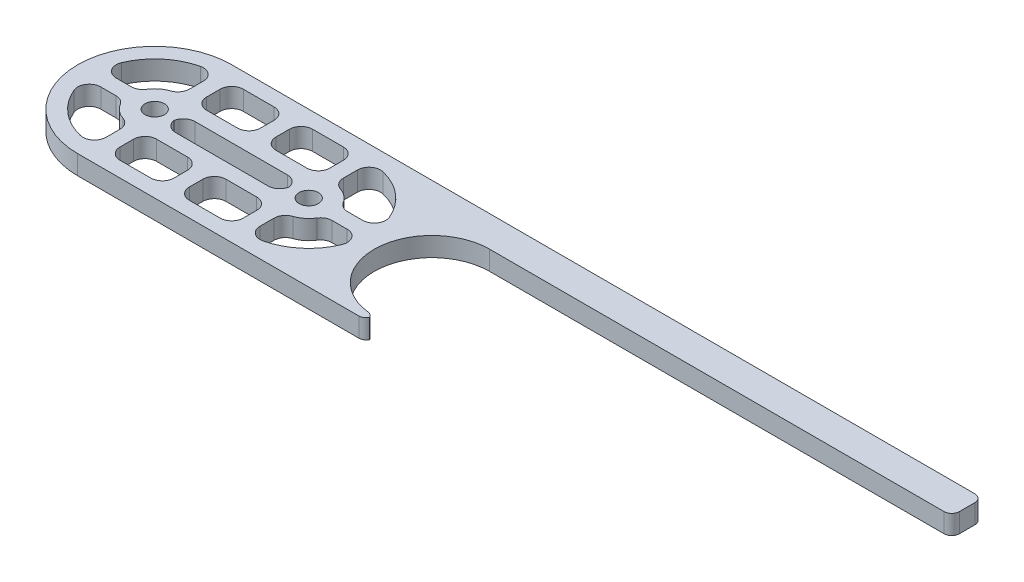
ISO-10303-21;
HEADER;
FILE_DESCRIPTION(('STEP AP214'),'2;1');
FILE_NAME('part.step','',(''),(''),'','','');
FILE_SCHEMA(('AUTOMOTIVE_DESIGN { 1 0 10303 214 1 1 1 1 }'));
ENDSEC;
DATA;
#1=APPLICATION_CONTEXT('core data for automotive mechanical design processes');
#2=APPLICATION_PROTOCOL_DEFINITION('international standard','automotive_design',2000,#1);
#3=PRODUCT_CONTEXT('',#1,'mechanical');
#4=PRODUCT('Part','Part','',(#3));
#5=PRODUCT_RELATED_PRODUCT_CATEGORY('part','',(#4));
#6=PRODUCT_DEFINITION_FORMATION('','',#4);
#7=PRODUCT_DEFINITION_CONTEXT('part definition',#1,'design');
#8=PRODUCT_DEFINITION('design','',#6,#7);
#9=PRODUCT_DEFINITION_SHAPE('','',#8);
#10=(LENGTH_UNIT() NAMED_UNIT(*) SI_UNIT(.MILLI.,.METRE.));
#11=(NAMED_UNIT(*) PLANE_ANGLE_UNIT() SI_UNIT($,.RADIAN.));
#12=(NAMED_UNIT(*) SI_UNIT($,.STERADIAN.) SOLID_ANGLE_UNIT());
#13=UNCERTAINTY_MEASURE_WITH_UNIT(LENGTH_MEASURE(1.E-05),#10,'distance_accuracy_value','');
#14=(GEOMETRIC_REPRESENTATION_CONTEXT(3) GLOBAL_UNCERTAINTY_ASSIGNED_CONTEXT((#13)) GLOBAL_UNIT_ASSIGNED_CONTEXT((#10,
#11,#12)) REPRESENTATION_CONTEXT('',''));
#15=CARTESIAN_POINT('',(0.,0.,0.));
#16=DIRECTION('',(0.,0.,1.));
#17=DIRECTION('',(1.,0.,0.));
#18=AXIS2_PLACEMENT_3D('',#15,#16,#17);
#19=CARTESIAN_POINT('',(0.,3.175,-22.86));
#20=DIRECTION('',(0.,0.,-1.));
#21=DIRECTION('',(-1.,0.,0.));
#22=AXIS2_PLACEMENT_3D('',#19,#20,#21);
#23=PLANE('',#22);
#24=DIRECTION('',(1.,0.,0.));
#25=VECTOR('',#24,1.);
#26=CARTESIAN_POINT('',(0.,0.,-22.86));
#27=LINE('',#26,#25);
#28=CARTESIAN_POINT('',(17.145,0.,-22.86));
#29=VERTEX_POINT('',#28);
#30=CARTESIAN_POINT('',(22.225,0.,-22.86));
#31=VERTEX_POINT('',#30);
#32=EDGE_CURVE('E772',#29,#31,#27,.T.);
#33=ORIENTED_EDGE('',*,*,#32,.T.);
#34=DIRECTION('',(0.,-1.,0.));
#35=VECTOR('',#34,1.);
#36=CARTESIAN_POINT('',(22.225,3.175,-22.86));
#37=LINE('',#36,#35);
#38=CARTESIAN_POINT('',(22.225,3.175,-22.86));
#39=VERTEX_POINT('',#38);
#40=EDGE_CURVE('E815',#31,#39,#37,.F.);
#41=ORIENTED_EDGE('',*,*,#40,.T.);
#42=DIRECTION('',(1.,0.,0.));
#43=VECTOR('',#42,1.);
#44=CARTESIAN_POINT('',(0.,3.175,-22.86));
#45=LINE('',#44,#43);
#46=CARTESIAN_POINT('',(17.145,3.175,-22.86));
#47=VERTEX_POINT('',#46);
#48=EDGE_CURVE('E784',#47,#39,#45,.T.);
#49=ORIENTED_EDGE('',*,*,#48,.F.);
#50=DIRECTION('',(0.,-1.,0.));
#51=VECTOR('',#50,1.);
#52=CARTESIAN_POINT('',(17.145,0.,-22.86));
#53=LINE('',#52,#51);
#54=EDGE_CURVE('E812',#47,#29,#53,.T.);
#55=ORIENTED_EDGE('',*,*,#54,.T.);
#56=EDGE_LOOP('',(#33,#41,#49,#55));
#57=FACE_BOUND('',#56,.T.);
#58=ADVANCED_FACE('F35',(#57),#23,.F.);
#59=CARTESIAN_POINT('',(0.,3.175,-16.8275));
#60=DIRECTION('',(0.,0.,-1.));
#61=DIRECTION('',(-1.,0.,0.));
#62=AXIS2_PLACEMENT_3D('',#59,#60,#61);
#63=PLANE('',#62);
#64=DIRECTION('',(1.,0.,0.));
#65=VECTOR('',#64,1.);
#66=CARTESIAN_POINT('',(0.,3.175,-16.8275));
#67=LINE('',#66,#65);
#68=CARTESIAN_POINT('',(17.145,3.175,-16.8275));
#69=VERTEX_POINT('',#68);
#70=CARTESIAN_POINT('',(22.225,3.175,-16.8275));
#71=VERTEX_POINT('',#70);
#72=EDGE_CURVE('E685',#69,#71,#67,.T.);
#73=ORIENTED_EDGE('',*,*,#72,.T.);
#74=DIRECTION('',(0.,-1.,0.));
#75=VECTOR('',#74,1.);
#76=CARTESIAN_POINT('',(22.225,0.,-16.8275));
#77=LINE('',#76,#75);
#78=CARTESIAN_POINT('',(22.225,0.,-16.8275));
#79=VERTEX_POINT('',#78);
#80=EDGE_CURVE('E834',#71,#79,#77,.T.);
#81=ORIENTED_EDGE('',*,*,#80,.T.);
#82=DIRECTION('',(1.,0.,0.));
#83=VECTOR('',#82,1.);
#84=CARTESIAN_POINT('',(0.,0.,-16.8275));
#85=LINE('',#84,#83);
#86=CARTESIAN_POINT('',(17.145,0.,-16.8275));
#87=VERTEX_POINT('',#86);
#88=EDGE_CURVE('E701',#87,#79,#85,.T.);
#89=ORIENTED_EDGE('',*,*,#88,.F.);
#90=DIRECTION('',(0.,-1.,0.));
#91=VECTOR('',#90,1.);
#92=CARTESIAN_POINT('',(17.145,3.175,-16.8275));
#93=LINE('',#92,#91);
#94=EDGE_CURVE('E832',#87,#69,#93,.F.);
#95=ORIENTED_EDGE('',*,*,#94,.T.);
#96=EDGE_LOOP('',(#73,#81,#89,#95));
#97=FACE_BOUND('',#96,.T.);
#98=ADVANCED_FACE('F1173',(#97),#63,.T.);
#99=CARTESIAN_POINT('',(38.1,3.175,-12.7));
#100=DIRECTION('',(0.,-1.,0.));
#101=DIRECTION('',(0.,0.,-1.));
#102=AXIS2_PLACEMENT_3D('',#99,#100,#101);
#103=CYLINDRICAL_SURFACE('',#102,10.16);
#104=CARTESIAN_POINT('',(38.1,0.,-12.7));
#105=DIRECTION('',(0.,-1.,0.));
#106=DIRECTION('',(0.,0.,-1.));
#107=AXIS2_PLACEMENT_3D('',#104,#105,#106);
#108=CIRCLE('',#107,10.16);
#109=CARTESIAN_POINT('',(40.4446153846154,0.,-22.5857664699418));
#110=VERTEX_POINT('',#109);
#111=CARTESIAN_POINT('',(47.4784615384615,0.,-16.6076923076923));
#112=VERTEX_POINT('',#111);
#113=EDGE_CURVE('E770',#110,#112,#108,.T.);
#114=ORIENTED_EDGE('',*,*,#113,.T.);
#115=DIRECTION('',(0.,-1.,0.));
#116=VECTOR('',#115,1.);
#117=CARTESIAN_POINT('',(47.4784615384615,3.175,-16.6076923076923));
#118=LINE('',#117,#116);
#119=CARTESIAN_POINT('',(47.4784615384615,3.175,-16.6076923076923));
#120=VERTEX_POINT('',#119);
#121=EDGE_CURVE('E825',#112,#120,#118,.F.);
#122=ORIENTED_EDGE('',*,*,#121,.T.);
#123=CARTESIAN_POINT('',(38.1,3.175,-12.7));
#124=DIRECTION('',(0.,-1.,0.));
#125=DIRECTION('',(0.,0.,-1.));
#126=AXIS2_PLACEMENT_3D('',#123,#124,#125);
#127=CIRCLE('',#126,10.16);
#128=CARTESIAN_POINT('',(40.4446153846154,3.175,-22.5857664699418));
#129=VERTEX_POINT('',#128);
#130=EDGE_CURVE('E744',#129,#120,#127,.T.);
#131=ORIENTED_EDGE('',*,*,#130,.F.);
#132=DIRECTION('',(0.,-1.,0.));
#133=VECTOR('',#132,1.);
#134=CARTESIAN_POINT('',(40.4446153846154,3.175,-22.5857664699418));
#135=LINE('',#134,#133);
#136=EDGE_CURVE('E822',#129,#110,#135,.T.);
#137=ORIENTED_EDGE('',*,*,#136,.T.);
#138=EDGE_LOOP('',(#114,#122,#131,#137));
#139=FACE_BOUND('',#138,.T.);
#140=ADVANCED_FACE('F1178',(#139),#103,.F.);
#141=CARTESIAN_POINT('',(47.4784615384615,3.175,-8.79230769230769));
#142=VERTEX_POINT('',#141);
#143=CARTESIAN_POINT('',(40.4446153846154,3.175,-2.81423353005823));
#144=VERTEX_POINT('',#143);
#145=EDGE_CURVE('E781',#142,#144,#127,.T.);
#146=ORIENTED_EDGE('',*,*,#145,.F.);
#147=DIRECTION('',(0.,-1.,0.));
#148=VECTOR('',#147,1.);
#149=CARTESIAN_POINT('',(47.4784615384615,3.175,-8.79230769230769));
#150=LINE('',#149,#148);
#151=CARTESIAN_POINT('',(47.4784615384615,0.,-8.79230769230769));
#152=VERTEX_POINT('',#151);
#153=EDGE_CURVE('E884',#142,#152,#150,.T.);
#154=ORIENTED_EDGE('',*,*,#153,.T.);
#155=CARTESIAN_POINT('',(40.4446153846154,0.,-2.81423353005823));
#156=VERTEX_POINT('',#155);
#157=EDGE_CURVE('E767',#152,#156,#108,.T.);
#158=ORIENTED_EDGE('',*,*,#157,.T.);
#159=DIRECTION('',(0.,-1.,0.));
#160=VECTOR('',#159,1.);
#161=CARTESIAN_POINT('',(40.4446153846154,3.175,-2.81423353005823));
#162=LINE('',#161,#160);
#163=EDGE_CURVE('E882',#156,#144,#162,.F.);
#164=ORIENTED_EDGE('',*,*,#163,.T.);
#165=EDGE_LOOP('',(#146,#154,#158,#164));
#166=FACE_BOUND('',#165,.T.);
#167=ADVANCED_FACE('F1186',(#166),#103,.F.);
#168=CARTESIAN_POINT('',(38.1,3.175,-12.7));
#169=DIRECTION('',(0.,-1.,0.));
#170=DIRECTION('',(0.,0.,-1.));
#171=AXIS2_PLACEMENT_3D('',#168,#169,#170);
#172=CYLINDRICAL_SURFACE('',#171,4.1275);
#173=CARTESIAN_POINT('',(38.1,3.175,-12.7));
#174=DIRECTION('',(0.,-1.,0.));
#175=DIRECTION('',(0.,0.,-1.));
#176=AXIS2_PLACEMENT_3D('',#173,#174,#175);
#177=CIRCLE('',#176,4.1275);
#178=CARTESIAN_POINT('',(39.4034210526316,3.175,-16.616292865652));
#179=VERTEX_POINT('',#178);
#180=CARTESIAN_POINT('',(41.6095685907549,3.175,-14.8723684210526));
#181=VERTEX_POINT('',#180);
#182=EDGE_CURVE('E684',#179,#181,#177,.T.);
#183=ORIENTED_EDGE('',*,*,#182,.T.);
#184=DIRECTION('',(0.,-1.,0.));
#185=VECTOR('',#184,1.);
#186=CARTESIAN_POINT('',(41.6095685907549,3.175,-14.8723684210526));
#187=LINE('',#186,#185);
#188=CARTESIAN_POINT('',(41.6095685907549,0.,-14.8723684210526));
#189=VERTEX_POINT('',#188);
#190=EDGE_CURVE('E839',#181,#189,#187,.T.);
#191=ORIENTED_EDGE('',*,*,#190,.T.);
#192=CARTESIAN_POINT('',(38.1,0.,-12.7));
#193=DIRECTION('',(0.,-1.,0.));
#194=DIRECTION('',(0.,0.,-1.));
#195=AXIS2_PLACEMENT_3D('',#192,#193,#194);
#196=CIRCLE('',#195,4.1275);
#197=CARTESIAN_POINT('',(39.4034210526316,0.,-16.616292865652));
#198=VERTEX_POINT('',#197);
#199=EDGE_CURVE('E700',#198,#189,#196,.T.);
#200=ORIENTED_EDGE('',*,*,#199,.F.);
#201=DIRECTION('',(0.,-1.,0.));
#202=VECTOR('',#201,1.);
#203=CARTESIAN_POINT('',(39.4034210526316,3.175,-16.616292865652));
#204=LINE('',#203,#202);
#205=EDGE_CURVE('E837',#198,#179,#204,.F.);
#206=ORIENTED_EDGE('',*,*,#205,.T.);
#207=EDGE_LOOP('',(#183,#191,#200,#206));
#208=FACE_BOUND('',#207,.T.);
#209=ADVANCED_FACE('F1786',(#208),#172,.T.);
#210=CARTESIAN_POINT('',(41.6095685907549,0.,-10.5276315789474));
#211=VERTEX_POINT('',#210);
#212=CARTESIAN_POINT('',(39.4034210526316,0.,-8.78370713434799));
#213=VERTEX_POINT('',#212);
#214=EDGE_CURVE('E697',#211,#213,#196,.T.);
#215=ORIENTED_EDGE('',*,*,#214,.F.);
#216=DIRECTION('',(0.,-1.,0.));
#217=VECTOR('',#216,1.);
#218=CARTESIAN_POINT('',(41.6095685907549,3.175,-10.5276315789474));
#219=LINE('',#218,#217);
#220=CARTESIAN_POINT('',(41.6095685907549,3.175,-10.5276315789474));
#221=VERTEX_POINT('',#220);
#222=EDGE_CURVE('E889',#211,#221,#219,.F.);
#223=ORIENTED_EDGE('',*,*,#222,.T.);
#224=CARTESIAN_POINT('',(39.4034210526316,3.175,-8.78370713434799));
#225=VERTEX_POINT('',#224);
#226=EDGE_CURVE('E681',#221,#225,#177,.T.);
#227=ORIENTED_EDGE('',*,*,#226,.T.);
#228=DIRECTION('',(0.,-1.,0.));
#229=VECTOR('',#228,1.);
#230=CARTESIAN_POINT('',(39.4034210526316,3.175,-8.78370713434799));
#231=LINE('',#230,#229);
#232=EDGE_CURVE('E886',#225,#213,#231,.T.);
#233=ORIENTED_EDGE('',*,*,#232,.T.);
#234=EDGE_LOOP('',(#215,#223,#227,#233));
#235=FACE_BOUND('',#234,.T.);
#236=ADVANCED_FACE('F1777',(#235),#172,.T.);
#237=CARTESIAN_POINT('',(0.,3.175,-2.54));
#238=DIRECTION('',(0.,0.,-1.));
#239=DIRECTION('',(-1.,0.,0.));
#240=AXIS2_PLACEMENT_3D('',#237,#238,#239);
#241=PLANE('',#240);
#242=DIRECTION('',(1.,0.,0.));
#243=VECTOR('',#242,1.);
#244=CARTESIAN_POINT('',(0.,3.175,-2.54));
#245=LINE('',#244,#243);
#246=CARTESIAN_POINT('',(28.575,3.175,-2.54));
#247=VERTEX_POINT('',#246);
#248=CARTESIAN_POINT('',(33.655,3.175,-2.54));
#249=VERTEX_POINT('',#248);
#250=EDGE_CURVE('E763',#247,#249,#245,.T.);
#251=ORIENTED_EDGE('',*,*,#250,.T.);
#252=DIRECTION('',(0.,-1.,0.));
#253=VECTOR('',#252,1.);
#254=CARTESIAN_POINT('',(33.655,3.175,-2.54));
#255=LINE('',#254,#253);
#256=CARTESIAN_POINT('',(33.655,0.,-2.54));
#257=VERTEX_POINT('',#256);
#258=EDGE_CURVE('E899',#249,#257,#255,.T.);
#259=ORIENTED_EDGE('',*,*,#258,.T.);
#260=DIRECTION('',(1.,0.,0.));
#261=VECTOR('',#260,1.);
#262=CARTESIAN_POINT('',(0.,0.,-2.54));
#263=LINE('',#262,#261);
#264=CARTESIAN_POINT('',(28.575,0.,-2.54));
#265=VERTEX_POINT('',#264);
#266=EDGE_CURVE('E758',#265,#257,#263,.T.);
#267=ORIENTED_EDGE('',*,*,#266,.F.);
#268=DIRECTION('',(0.,-1.,0.));
#269=VECTOR('',#268,1.);
#270=CARTESIAN_POINT('',(28.575,3.175,-2.54));
#271=LINE('',#270,#269);
#272=EDGE_CURVE('E897',#265,#247,#271,.F.);
#273=ORIENTED_EDGE('',*,*,#272,.T.);
#274=EDGE_LOOP('',(#251,#259,#267,#273));
#275=FACE_BOUND('',#274,.T.);
#276=ADVANCED_FACE('F1193',(#275),#241,.T.);
#277=CARTESIAN_POINT('',(0.,3.175,-8.5725));
#278=DIRECTION('',(0.,0.,-1.));
#279=DIRECTION('',(-1.,0.,0.));
#280=AXIS2_PLACEMENT_3D('',#277,#278,#279);
#281=PLANE('',#280);
#282=DIRECTION('',(1.,0.,0.));
#283=VECTOR('',#282,1.);
#284=CARTESIAN_POINT('',(0.,0.,-8.5725));
#285=LINE('',#284,#283);
#286=CARTESIAN_POINT('',(28.575,0.,-8.5725));
#287=VERTEX_POINT('',#286);
#288=CARTESIAN_POINT('',(33.655,0.,-8.5725));
#289=VERTEX_POINT('',#288);
#290=EDGE_CURVE('E693',#287,#289,#285,.T.);
#291=ORIENTED_EDGE('',*,*,#290,.T.);
#292=DIRECTION('',(0.,-1.,0.));
#293=VECTOR('',#292,1.);
#294=CARTESIAN_POINT('',(33.655,3.175,-8.5725));
#295=LINE('',#294,#293);
#296=CARTESIAN_POINT('',(33.655,3.175,-8.5725));
#297=VERTEX_POINT('',#296);
#298=EDGE_CURVE('E910',#289,#297,#295,.F.);
#299=ORIENTED_EDGE('',*,*,#298,.T.);
#300=DIRECTION('',(1.,0.,0.));
#301=VECTOR('',#300,1.);
#302=CARTESIAN_POINT('',(0.,3.175,-8.5725));
#303=LINE('',#302,#301);
#304=CARTESIAN_POINT('',(28.575,3.175,-8.5725));
#305=VERTEX_POINT('',#304);
#306=EDGE_CURVE('E676',#305,#297,#303,.T.);
#307=ORIENTED_EDGE('',*,*,#306,.F.);
#308=DIRECTION('',(0.,-1.,0.));
#309=VECTOR('',#308,1.);
#310=CARTESIAN_POINT('',(28.575,3.175,-8.5725));
#311=LINE('',#310,#309);
#312=EDGE_CURVE('E907',#305,#287,#311,.T.);
#313=ORIENTED_EDGE('',*,*,#312,.T.);
#314=EDGE_LOOP('',(#291,#299,#307,#313));
#315=FACE_BOUND('',#314,.T.);
#316=ADVANCED_FACE('F1700',(#315),#281,.F.);
#317=CARTESIAN_POINT('',(12.7,3.175,-12.7));
#318=DIRECTION('',(0.,-1.,0.));
#319=DIRECTION('',(0.,0.,-1.));
#320=AXIS2_PLACEMENT_3D('',#317,#318,#319);
#321=CYLINDRICAL_SURFACE('',#320,10.16);
#322=CARTESIAN_POINT('',(12.7,0.,-12.7));
#323=DIRECTION('',(0.,-1.,0.));
#324=DIRECTION('',(0.,0.,-1.));
#325=AXIS2_PLACEMENT_3D('',#322,#323,#324);
#326=CIRCLE('',#325,10.16);
#327=CARTESIAN_POINT('',(10.3553846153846,0.,-2.81423353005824));
#328=VERTEX_POINT('',#327);
#329=CARTESIAN_POINT('',(3.32153846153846,0.,-8.79230769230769));
#330=VERTEX_POINT('',#329);
#331=EDGE_CURVE('E760',#328,#330,#326,.T.);
#332=ORIENTED_EDGE('',*,*,#331,.T.);
#333=DIRECTION('',(0.,-1.,0.));
#334=VECTOR('',#333,1.);
#335=CARTESIAN_POINT('',(3.32153846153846,3.175,-8.79230769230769));
#336=LINE('',#335,#334);
#337=CARTESIAN_POINT('',(3.32153846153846,3.175,-8.79230769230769));
#338=VERTEX_POINT('',#337);
#339=EDGE_CURVE('E920',#330,#338,#336,.F.);
#340=ORIENTED_EDGE('',*,*,#339,.T.);
#341=CARTESIAN_POINT('',(12.7,3.175,-12.7));
#342=DIRECTION('',(0.,-1.,0.));
#343=DIRECTION('',(0.,0.,-1.));
#344=AXIS2_PLACEMENT_3D('',#341,#342,#343);
#345=CIRCLE('',#344,10.16);
#346=CARTESIAN_POINT('',(10.3553846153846,3.175,-2.81423353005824));
#347=VERTEX_POINT('',#346);
#348=EDGE_CURVE('E775',#347,#338,#345,.T.);
#349=ORIENTED_EDGE('',*,*,#348,.F.);
#350=DIRECTION('',(0.,-1.,0.));
#351=VECTOR('',#350,1.);
#352=CARTESIAN_POINT('',(10.3553846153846,3.175,-2.81423353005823));
#353=LINE('',#352,#351);
#354=EDGE_CURVE('E917',#347,#328,#353,.T.);
#355=ORIENTED_EDGE('',*,*,#354,.T.);
#356=EDGE_LOOP('',(#332,#340,#349,#355));
#357=FACE_BOUND('',#356,.T.);
#358=ADVANCED_FACE('F1197',(#357),#321,.F.);
#359=CARTESIAN_POINT('',(12.7,3.175,-12.7));
#360=DIRECTION('',(0.,-1.,0.));
#361=DIRECTION('',(0.,0.,-1.));
#362=AXIS2_PLACEMENT_3D('',#359,#360,#361);
#363=CYLINDRICAL_SURFACE('',#362,4.1275);
#364=CARTESIAN_POINT('',(12.7,3.175,-12.7));
#365=DIRECTION('',(0.,-1.,0.));
#366=DIRECTION('',(0.,0.,-1.));
#367=AXIS2_PLACEMENT_3D('',#364,#365,#366);
#368=CIRCLE('',#367,4.1275);
#369=CARTESIAN_POINT('',(11.3965789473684,3.175,-8.78370713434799));
#370=VERTEX_POINT('',#369);
#371=CARTESIAN_POINT('',(9.19043140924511,3.175,-10.5276315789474));
#372=VERTEX_POINT('',#371);
#373=EDGE_CURVE('E673',#370,#372,#368,.T.);
#374=ORIENTED_EDGE('',*,*,#373,.T.);
#375=DIRECTION('',(0.,-1.,0.));
#376=VECTOR('',#375,1.);
#377=CARTESIAN_POINT('',(9.1904314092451,3.175,-10.5276315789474));
#378=LINE('',#377,#376);
#379=CARTESIAN_POINT('',(9.19043140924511,0.,-10.5276315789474));
#380=VERTEX_POINT('',#379);
#381=EDGE_CURVE('E930',#372,#380,#378,.T.);
#382=ORIENTED_EDGE('',*,*,#381,.T.);
#383=CARTESIAN_POINT('',(12.7,0.,-12.7));
#384=DIRECTION('',(0.,-1.,0.));
#385=DIRECTION('',(0.,0.,-1.));
#386=AXIS2_PLACEMENT_3D('',#383,#384,#385);
#387=CIRCLE('',#386,4.1275);
#388=CARTESIAN_POINT('',(11.3965789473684,0.,-8.78370713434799));
#389=VERTEX_POINT('',#388);
#390=EDGE_CURVE('E690',#389,#380,#387,.T.);
#391=ORIENTED_EDGE('',*,*,#390,.F.);
#392=DIRECTION('',(0.,-1.,0.));
#393=VECTOR('',#392,1.);
#394=CARTESIAN_POINT('',(11.3965789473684,3.175,-8.78370713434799));
#395=LINE('',#394,#393);
#396=EDGE_CURVE('E928',#389,#370,#395,.F.);
#397=ORIENTED_EDGE('',*,*,#396,.T.);
#398=EDGE_LOOP('',(#374,#382,#391,#397));
#399=FACE_BOUND('',#398,.T.);
#400=ADVANCED_FACE('F1404',(#399),#363,.T.);
#401=CARTESIAN_POINT('',(0.,3.175,0.));
#402=DIRECTION('',(0.,0.,-1.));
#403=DIRECTION('',(-1.,0.,0.));
#404=AXIS2_PLACEMENT_3D('',#401,#402,#403);
#405=PLANE('',#404);
#406=DIRECTION('',(1.,0.,0.));
#407=VECTOR('',#406,1.);
#408=CARTESIAN_POINT('',(0.,0.,0.));
#409=LINE('',#408,#407);
#410=CARTESIAN_POINT('',(12.7,0.,0.));
#411=VERTEX_POINT('',#410);
#412=CARTESIAN_POINT('',(59.055,0.,0.));
#413=VERTEX_POINT('',#412);
#414=EDGE_CURVE('E752',#411,#413,#409,.T.);
#415=ORIENTED_EDGE('',*,*,#414,.T.);
#416=DIRECTION('',(0.,-1.,0.));
#417=VECTOR('',#416,1.);
#418=CARTESIAN_POINT('',(59.055,3.175,0.));
#419=LINE('',#418,#417);
#420=CARTESIAN_POINT('',(59.055,3.175,0.));
#421=VERTEX_POINT('',#420);
#422=EDGE_CURVE('E11',#413,#421,#419,.F.);
#423=ORIENTED_EDGE('',*,*,#422,.T.);
#424=DIRECTION('',(1.,0.,0.));
#425=VECTOR('',#424,1.);
#426=CARTESIAN_POINT('',(0.,3.175,0.));
#427=LINE('',#426,#425);
#428=CARTESIAN_POINT('',(12.7,3.175,0.));
#429=VERTEX_POINT('',#428);
#430=EDGE_CURVE('E741',#429,#421,#427,.T.);
#431=ORIENTED_EDGE('',*,*,#430,.F.);
#432=DIRECTION('',(0.,-1.,0.));
#433=VECTOR('',#432,1.);
#434=CARTESIAN_POINT('',(12.7,3.175,0.));
#435=LINE('',#434,#433);
#436=EDGE_CURVE('E724',#429,#411,#435,.T.);
#437=ORIENTED_EDGE('',*,*,#436,.T.);
#438=EDGE_LOOP('',(#415,#423,#431,#437));
#439=FACE_BOUND('',#438,.T.);
#440=ADVANCED_FACE('F1157',(#439),#405,.F.);
#441=CARTESIAN_POINT('',(0.,3.175,-25.4));
#442=DIRECTION('',(0.,0.,1.));
#443=DIRECTION('',(1.,0.,0.));
#444=AXIS2_PLACEMENT_3D('',#441,#442,#443);
#445=PLANE('',#444);
#446=DIRECTION('',(-1.,0.,0.));
#447=VECTOR('',#446,1.);
#448=CARTESIAN_POINT('',(0.,3.175,-25.4));
#449=LINE('',#448,#447);
#450=CARTESIAN_POINT('',(135.255,3.175,-25.4));
#451=VERTEX_POINT('',#450);
#452=CARTESIAN_POINT('',(12.7,3.175,-25.4));
#453=VERTEX_POINT('',#452);
#454=EDGE_CURVE('E756',#451,#453,#449,.T.);
#455=ORIENTED_EDGE('',*,*,#454,.F.);
#456=DIRECTION('',(0.,-1.,0.));
#457=VECTOR('',#456,1.);
#458=CARTESIAN_POINT('',(135.255,0.,-25.4));
#459=LINE('',#458,#457);
#460=CARTESIAN_POINT('',(135.255,0.,-25.4));
#461=VERTEX_POINT('',#460);
#462=EDGE_CURVE('E1124',#451,#461,#459,.T.);
#463=ORIENTED_EDGE('',*,*,#462,.T.);
#464=DIRECTION('',(-1.,0.,0.));
#465=VECTOR('',#464,1.);
#466=CARTESIAN_POINT('',(0.,0.,-25.4));
#467=LINE('',#466,#465);
#468=CARTESIAN_POINT('',(12.7,0.,-25.4));
#469=VERTEX_POINT('',#468);
#470=EDGE_CURVE('E738',#461,#469,#467,.T.);
#471=ORIENTED_EDGE('',*,*,#470,.T.);
#472=DIRECTION('',(0.,-1.,0.));
#473=VECTOR('',#472,1.);
#474=CARTESIAN_POINT('',(12.7,3.175,-25.4));
#475=LINE('',#474,#473);
#476=EDGE_CURVE('E734',#469,#453,#475,.F.);
#477=ORIENTED_EDGE('',*,*,#476,.T.);
#478=EDGE_LOOP('',(#455,#463,#471,#477));
#479=FACE_BOUND('',#478,.T.);
#480=ADVANCED_FACE('F1144',(#479),#445,.F.);
#481=CARTESIAN_POINT('',(0.,3.175,0.));
#482=DIRECTION('',(0.,-1.,0.));
#483=DIRECTION('',(0.,0.,-1.));
#484=AXIS2_PLACEMENT_3D('',#481,#482,#483);
#485=PLANE('',#484);
#486=CARTESIAN_POINT('',(33.02,3.175,-12.35075));
#487=DIRECTION('',(0.,-1.,0.));
#488=DIRECTION('',(0.,0.,-1.));
#489=AXIS2_PLACEMENT_3D('',#486,#487,#488);
#490=CIRCLE('',#489,1.905);
#491=CARTESIAN_POINT('',(33.02,3.175,-14.25575));
#492=VERTEX_POINT('',#491);
#493=CARTESIAN_POINT('',(34.8983553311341,3.175,-12.66825));
#494=VERTEX_POINT('',#493);
#495=EDGE_CURVE('E963',#492,#494,#490,.T.);
#496=ORIENTED_EDGE('',*,*,#495,.T.);
#497=CARTESIAN_POINT('',(33.02,3.175,-12.98575));
#498=DIRECTION('',(0.,-1.,0.));
#499=DIRECTION('',(0.,0.,-1.));
#500=AXIS2_PLACEMENT_3D('',#497,#498,#499);
#501=CIRCLE('',#500,1.905);
#502=CARTESIAN_POINT('',(33.02,3.175,-11.08075));
#503=VERTEX_POINT('',#502);
#504=EDGE_CURVE('E967',#494,#503,#501,.T.);
#505=ORIENTED_EDGE('',*,*,#504,.T.);
#506=DIRECTION('',(-1.,0.,0.));
#507=VECTOR('',#506,1.);
#508=CARTESIAN_POINT('',(15.875,3.175,-11.08075));
#509=LINE('',#508,#507);
#510=CARTESIAN_POINT('',(17.78,3.175,-11.08075));
#511=VERTEX_POINT('',#510);
#512=EDGE_CURVE('E578',#503,#511,#509,.T.);
#513=ORIENTED_EDGE('',*,*,#512,.T.);
#514=CARTESIAN_POINT('',(17.78,3.175,-12.98575));
#515=DIRECTION('',(0.,-1.,0.));
#516=DIRECTION('',(0.,0.,-1.));
#517=AXIS2_PLACEMENT_3D('',#514,#515,#516);
#518=CIRCLE('',#517,1.905);
#519=CARTESIAN_POINT('',(15.9016446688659,3.175,-12.66825));
#520=VERTEX_POINT('',#519);
#521=EDGE_CURVE('E971',#511,#520,#518,.T.);
#522=ORIENTED_EDGE('',*,*,#521,.T.);
#523=CARTESIAN_POINT('',(17.78,3.175,-12.35075));
#524=DIRECTION('',(0.,-1.,0.));
#525=DIRECTION('',(0.,0.,-1.));
#526=AXIS2_PLACEMENT_3D('',#523,#524,#525);
#527=CIRCLE('',#526,1.905);
#528=CARTESIAN_POINT('',(17.78,3.175,-14.25575));
#529=VERTEX_POINT('',#528);
#530=EDGE_CURVE('E959',#520,#529,#527,.T.);
#531=ORIENTED_EDGE('',*,*,#530,.T.);
#532=DIRECTION('',(1.,0.,0.));
#533=VECTOR('',#532,1.);
#534=CARTESIAN_POINT('',(15.875,3.175,-14.25575));
#535=LINE('',#534,#533);
#536=EDGE_CURVE('E575',#529,#492,#535,.T.);
#537=ORIENTED_EDGE('',*,*,#536,.T.);
#538=EDGE_LOOP('',(#496,#505,#513,#522,#531,#537));
#539=FACE_BOUND('',#538,.T.);
#540=DIRECTION('',(0.,0.,-1.));
#541=VECTOR('',#540,1.);
#542=CARTESIAN_POINT('',(12.7,3.175,-8.5725));
#543=LINE('',#542,#541);
#544=CARTESIAN_POINT('',(12.7,3.175,-4.66781474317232));
#545=VERTEX_POINT('',#544);
#546=CARTESIAN_POINT('',(12.7,3.175,-6.97618735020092));
#547=VERTEX_POINT('',#546);
#548=EDGE_CURVE('E661',#545,#547,#543,.T.);
#549=ORIENTED_EDGE('',*,*,#548,.F.);
#550=CARTESIAN_POINT('',(10.795,3.175,-4.66781474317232));
#551=DIRECTION('',(0.,-1.,0.));
#552=DIRECTION('',(0.,0.,-1.));
#553=AXIS2_PLACEMENT_3D('',#550,#551,#552);
#554=CIRCLE('',#553,1.905);
#555=EDGE_CURVE('E1083',#545,#347,#554,.T.);
#556=ORIENTED_EDGE('',*,*,#555,.T.);
#557=ORIENTED_EDGE('',*,*,#348,.T.);
#558=CARTESIAN_POINT('',(5.08,3.175,-9.525));
#559=DIRECTION('',(0.,-1.,0.));
#560=DIRECTION('',(0.,0.,-1.));
#561=AXIS2_PLACEMENT_3D('',#558,#559,#560);
#562=CIRCLE('',#561,1.905);
#563=CARTESIAN_POINT('',(5.08,3.175,-11.43));
#564=VERTEX_POINT('',#563);
#565=EDGE_CURVE('E1069',#338,#564,#562,.T.);
#566=ORIENTED_EDGE('',*,*,#565,.T.);
#567=DIRECTION('',(-1.,0.,0.));
#568=VECTOR('',#567,1.);
#569=CARTESIAN_POINT('',(2.54,3.175,-11.43));
#570=LINE('',#569,#568);
#571=CARTESIAN_POINT('',(7.57063052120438,3.175,-11.43));
#572=VERTEX_POINT('',#571);
#573=EDGE_CURVE('E652',#572,#564,#570,.T.);
#574=ORIENTED_EDGE('',*,*,#573,.F.);
#575=CARTESIAN_POINT('',(7.57063052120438,3.175,-9.525));
#576=DIRECTION('',(0.,-1.,0.));
#577=DIRECTION('',(0.,0.,-1.));
#578=AXIS2_PLACEMENT_3D('',#575,#576,#577);
#579=CIRCLE('',#578,1.905);
#580=EDGE_CURVE('E1073',#572,#372,#579,.T.);
#581=ORIENTED_EDGE('',*,*,#580,.T.);
#582=ORIENTED_EDGE('',*,*,#373,.F.);
#583=CARTESIAN_POINT('',(10.795,3.175,-6.97618735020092));
#584=DIRECTION('',(0.,-1.,0.));
#585=DIRECTION('',(0.,0.,-1.));
#586=AXIS2_PLACEMENT_3D('',#583,#584,#585);
#587=CIRCLE('',#586,1.905);
#588=EDGE_CURVE('E1079',#370,#547,#587,.T.);
#589=ORIENTED_EDGE('',*,*,#588,.T.);
#590=EDGE_LOOP('',(#549,#556,#557,#566,#574,#581,#582,#589));
#591=FACE_BOUND('',#590,.T.);
#592=CARTESIAN_POINT('',(9.19043140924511,3.175,-14.8723684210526));
#593=VERTEX_POINT('',#592);
#594=CARTESIAN_POINT('',(11.3965789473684,3.175,-16.616292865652));
#595=VERTEX_POINT('',#594);
#596=EDGE_CURVE('E677',#593,#595,#368,.T.);
#597=ORIENTED_EDGE('',*,*,#596,.F.);
#598=CARTESIAN_POINT('',(7.57063052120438,3.175,-15.875));
#599=DIRECTION('',(0.,-1.,0.));
#600=DIRECTION('',(0.,0.,-1.));
#601=AXIS2_PLACEMENT_3D('',#598,#599,#600);
#602=CIRCLE('',#601,1.905);
#603=CARTESIAN_POINT('',(7.57063052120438,3.175,-13.97));
#604=VERTEX_POINT('',#603);
#605=EDGE_CURVE('E1031',#593,#604,#602,.T.);
#606=ORIENTED_EDGE('',*,*,#605,.T.);
#607=DIRECTION('',(1.,0.,0.));
#608=VECTOR('',#607,1.);
#609=CARTESIAN_POINT('',(2.54,3.175,-13.97));
#610=LINE('',#609,#608);
#611=CARTESIAN_POINT('',(5.08,3.175,-13.97));
#612=VERTEX_POINT('',#611);
#613=EDGE_CURVE('E649',#612,#604,#610,.T.);
#614=ORIENTED_EDGE('',*,*,#613,.F.);
#615=CARTESIAN_POINT('',(5.08,3.175,-15.875));
#616=DIRECTION('',(0.,-1.,0.));
#617=DIRECTION('',(0.,0.,-1.));
#618=AXIS2_PLACEMENT_3D('',#615,#616,#617);
#619=CIRCLE('',#618,1.905);
#620=CARTESIAN_POINT('',(3.32153846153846,3.175,-16.6076923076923));
#621=VERTEX_POINT('',#620);
#622=EDGE_CURVE('E1035',#612,#621,#619,.T.);
#623=ORIENTED_EDGE('',*,*,#622,.T.);
#624=CARTESIAN_POINT('',(10.3553846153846,3.175,-22.5857664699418));
#625=VERTEX_POINT('',#624);
#626=EDGE_CURVE('E737',#621,#625,#345,.T.);
#627=ORIENTED_EDGE('',*,*,#626,.T.);
#628=CARTESIAN_POINT('',(10.795,3.175,-20.7321852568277));
#629=DIRECTION('',(0.,-1.,0.));
#630=DIRECTION('',(0.,0.,-1.));
#631=AXIS2_PLACEMENT_3D('',#628,#629,#630);
#632=CIRCLE('',#631,1.905);
#633=CARTESIAN_POINT('',(12.7,3.175,-20.7321852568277));
#634=VERTEX_POINT('',#633);
#635=EDGE_CURVE('E1027',#625,#634,#632,.T.);
#636=ORIENTED_EDGE('',*,*,#635,.T.);
#637=DIRECTION('',(0.,0.,1.));
#638=VECTOR('',#637,1.);
#639=CARTESIAN_POINT('',(12.7,3.175,-16.8275));
#640=LINE('',#639,#638);
#641=CARTESIAN_POINT('',(12.7,3.175,-18.4238126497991));
#642=VERTEX_POINT('',#641);
#643=EDGE_CURVE('E589',#634,#642,#640,.T.);
#644=ORIENTED_EDGE('',*,*,#643,.T.);
#645=CARTESIAN_POINT('',(10.795,3.175,-18.4238126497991));
#646=DIRECTION('',(0.,-1.,0.));
#647=DIRECTION('',(0.,0.,-1.));
#648=AXIS2_PLACEMENT_3D('',#645,#646,#647);
#649=CIRCLE('',#648,1.905);
#650=EDGE_CURVE('E1023',#642,#595,#649,.T.);
#651=ORIENTED_EDGE('',*,*,#650,.T.);
#652=EDGE_LOOP('',(#597,#606,#614,#623,#627,#636,#644,#651));
#653=FACE_BOUND('',#652,.T.);
#654=ORIENTED_EDGE('',*,*,#130,.T.);
#655=CARTESIAN_POINT('',(45.72,3.175,-15.875));
#656=DIRECTION('',(0.,-1.,0.));
#657=DIRECTION('',(0.,0.,-1.));
#658=AXIS2_PLACEMENT_3D('',#655,#656,#657);
#659=CIRCLE('',#658,1.905);
#660=CARTESIAN_POINT('',(45.72,3.175,-13.97));
#661=VERTEX_POINT('',#660);
#662=EDGE_CURVE('E983',#120,#661,#659,.T.);
#663=ORIENTED_EDGE('',*,*,#662,.T.);
#664=DIRECTION('',(-1.,0.,0.));
#665=VECTOR('',#664,1.);
#666=CARTESIAN_POINT('',(48.26,3.175,-13.97));
#667=LINE('',#666,#665);
#668=CARTESIAN_POINT('',(43.2293694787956,3.175,-13.97));
#669=VERTEX_POINT('',#668);
#670=EDGE_CURVE('E628',#661,#669,#667,.T.);
#671=ORIENTED_EDGE('',*,*,#670,.T.);
#672=CARTESIAN_POINT('',(43.2293694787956,3.175,-15.875));
#673=DIRECTION('',(0.,-1.,0.));
#674=DIRECTION('',(0.,0.,-1.));
#675=AXIS2_PLACEMENT_3D('',#672,#673,#674);
#676=CIRCLE('',#675,1.905);
#677=EDGE_CURVE('E995',#669,#181,#676,.T.);
#678=ORIENTED_EDGE('',*,*,#677,.T.);
#679=ORIENTED_EDGE('',*,*,#182,.F.);
#680=CARTESIAN_POINT('',(40.005,3.175,-18.4238126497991));
#681=DIRECTION('',(0.,-1.,0.));
#682=DIRECTION('',(0.,0.,-1.));
#683=AXIS2_PLACEMENT_3D('',#680,#681,#682);
#684=CIRCLE('',#683,1.905);
#685=CARTESIAN_POINT('',(38.1,3.175,-18.4238126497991));
#686=VERTEX_POINT('',#685);
#687=EDGE_CURVE('E999',#179,#686,#684,.T.);
#688=ORIENTED_EDGE('',*,*,#687,.T.);
#689=DIRECTION('',(0.,0.,1.));
#690=VECTOR('',#689,1.);
#691=CARTESIAN_POINT('',(38.1,3.175,-16.8275));
#692=LINE('',#691,#690);
#693=CARTESIAN_POINT('',(38.1,3.175,-20.7321852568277));
#694=VERTEX_POINT('',#693);
#695=EDGE_CURVE('E601',#694,#686,#692,.T.);
#696=ORIENTED_EDGE('',*,*,#695,.F.);
#697=CARTESIAN_POINT('',(40.005,3.175,-20.7321852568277));
#698=DIRECTION('',(0.,-1.,0.));
#699=DIRECTION('',(0.,0.,-1.));
#700=AXIS2_PLACEMENT_3D('',#697,#698,#699);
#701=CIRCLE('',#700,1.905);
#702=EDGE_CURVE('E1007',#694,#129,#701,.T.);
#703=ORIENTED_EDGE('',*,*,#702,.T.);
#704=EDGE_LOOP('',(#654,#663,#671,#678,#679,#688,#696,#703));
#705=FACE_BOUND('',#704,.T.);
#706=ORIENTED_EDGE('',*,*,#226,.F.);
#707=CARTESIAN_POINT('',(43.2293694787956,3.175,-9.525));
#708=DIRECTION('',(0.,-1.,0.));
#709=DIRECTION('',(0.,0.,-1.));
#710=AXIS2_PLACEMENT_3D('',#707,#708,#709);
#711=CIRCLE('',#710,1.905);
#712=CARTESIAN_POINT('',(43.2293694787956,3.175,-11.43));
#713=VERTEX_POINT('',#712);
#714=EDGE_CURVE('E1041',#221,#713,#711,.T.);
#715=ORIENTED_EDGE('',*,*,#714,.T.);
#716=DIRECTION('',(1.,0.,0.));
#717=VECTOR('',#716,1.);
#718=CARTESIAN_POINT('',(48.26,3.175,-11.43));
#719=LINE('',#718,#717);
#720=CARTESIAN_POINT('',(45.72,3.175,-11.43));
#721=VERTEX_POINT('',#720);
#722=EDGE_CURVE('E625',#713,#721,#719,.T.);
#723=ORIENTED_EDGE('',*,*,#722,.T.);
#724=CARTESIAN_POINT('',(45.72,3.175,-9.525));
#725=DIRECTION('',(0.,-1.,0.));
#726=DIRECTION('',(0.,0.,-1.));
#727=AXIS2_PLACEMENT_3D('',#724,#725,#726);
#728=CIRCLE('',#727,1.905);
#729=EDGE_CURVE('E1037',#721,#142,#728,.T.);
#730=ORIENTED_EDGE('',*,*,#729,.T.);
#731=ORIENTED_EDGE('',*,*,#145,.T.);
#732=CARTESIAN_POINT('',(40.005,3.175,-4.66781474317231));
#733=DIRECTION('',(0.,-1.,0.));
#734=DIRECTION('',(0.,0.,-1.));
#735=AXIS2_PLACEMENT_3D('',#732,#733,#734);
#736=CIRCLE('',#735,1.905);
#737=CARTESIAN_POINT('',(38.1,3.175,-4.66781474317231));
#738=VERTEX_POINT('',#737);
#739=EDGE_CURVE('E1051',#144,#738,#736,.T.);
#740=ORIENTED_EDGE('',*,*,#739,.T.);
#741=DIRECTION('',(0.,0.,-1.));
#742=VECTOR('',#741,1.);
#743=CARTESIAN_POINT('',(38.1,3.175,-8.5725));
#744=LINE('',#743,#742);
#745=CARTESIAN_POINT('',(38.1,3.175,-6.97618735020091));
#746=VERTEX_POINT('',#745);
#747=EDGE_CURVE('E637',#738,#746,#744,.T.);
#748=ORIENTED_EDGE('',*,*,#747,.T.);
#749=CARTESIAN_POINT('',(40.005,3.175,-6.97618735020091));
#750=DIRECTION('',(0.,-1.,0.));
#751=DIRECTION('',(0.,0.,-1.));
#752=AXIS2_PLACEMENT_3D('',#749,#750,#751);
#753=CIRCLE('',#752,1.905);
#754=EDGE_CURVE('E1047',#746,#225,#753,.T.);
#755=ORIENTED_EDGE('',*,*,#754,.T.);
#756=EDGE_LOOP('',(#706,#715,#723,#730,#731,#740,#748,#755));
#757=FACE_BOUND('',#756,.T.);
#758=DIRECTION('',(-1.,0.,0.));
#759=VECTOR('',#758,1.);
#760=CARTESIAN_POINT('',(136.525,3.175,-20.32));
#761=LINE('',#760,#759);
#762=CARTESIAN_POINT('',(135.255,3.175,-20.32));
#763=VERTEX_POINT('',#762);
#764=CARTESIAN_POINT('',(60.325,3.175,-20.32));
#765=VERTEX_POINT('',#764);
#766=EDGE_CURVE('E539',#763,#765,#761,.T.);
#767=ORIENTED_EDGE('',*,*,#766,.F.);
#768=CARTESIAN_POINT('',(135.255,3.175,-21.59));
#769=DIRECTION('',(0.,-1.,0.));
#770=DIRECTION('',(0.,0.,-1.));
#771=AXIS2_PLACEMENT_3D('',#768,#769,#770);
#772=CIRCLE('',#771,1.27);
#773=CARTESIAN_POINT('',(136.525,3.175,-21.59));
#774=VERTEX_POINT('',#773);
#775=EDGE_CURVE('E1122',#763,#774,#772,.F.);
#776=ORIENTED_EDGE('',*,*,#775,.T.);
#777=DIRECTION('',(0.,0.,1.));
#778=VECTOR('',#777,1.);
#779=CARTESIAN_POINT('',(136.525,3.175,-25.4));
#780=LINE('',#779,#778);
#781=CARTESIAN_POINT('',(136.525,3.175,-24.13));
#782=VERTEX_POINT('',#781);
#783=EDGE_CURVE('E549',#782,#774,#780,.T.);
#784=ORIENTED_EDGE('',*,*,#783,.F.);
#785=CARTESIAN_POINT('',(135.255,3.175,-24.13));
#786=DIRECTION('',(0.,-1.,0.));
#787=DIRECTION('',(0.,0.,-1.));
#788=AXIS2_PLACEMENT_3D('',#785,#786,#787);
#789=CIRCLE('',#788,1.27);
#790=EDGE_CURVE('E58',#782,#451,#789,.F.);
#791=ORIENTED_EDGE('',*,*,#790,.T.);
#792=ORIENTED_EDGE('',*,*,#454,.T.);
#793=CARTESIAN_POINT('',(12.7,3.175,-12.7));
#794=DIRECTION('',(0.,-1.,0.));
#795=DIRECTION('',(0.,0.,-1.));
#796=AXIS2_PLACEMENT_3D('',#793,#794,#795);
#797=CIRCLE('',#796,12.7);
#798=CARTESIAN_POINT('',(0.,3.175,-12.7));
#799=VERTEX_POINT('',#798);
#800=EDGE_CURVE('E742',#453,#799,#797,.F.);
#801=ORIENTED_EDGE('',*,*,#800,.T.);
#802=CARTESIAN_POINT('',(12.7,3.175,-12.7));
#803=DIRECTION('',(0.,-1.,0.));
#804=DIRECTION('',(0.,0.,-1.));
#805=AXIS2_PLACEMENT_3D('',#802,#803,#804);
#806=CIRCLE('',#805,12.7);
#807=EDGE_CURVE('E739',#799,#429,#806,.F.);
#808=ORIENTED_EDGE('',*,*,#807,.T.);
#809=ORIENTED_EDGE('',*,*,#430,.T.);
#810=CARTESIAN_POINT('',(59.055,3.175,-1.27));
#811=DIRECTION('',(0.,-1.,0.));
#812=DIRECTION('',(0.,0.,-1.));
#813=AXIS2_PLACEMENT_3D('',#810,#811,#812);
#814=CIRCLE('',#813,1.27);
#815=CARTESIAN_POINT('',(60.1756576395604,3.175,-0.672483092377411));
#816=VERTEX_POINT('',#815);
#817=EDGE_CURVE('E51',#421,#816,#814,.F.);
#818=ORIENTED_EDGE('',*,*,#817,.T.);
#819=CARTESIAN_POINT('',(59.055,3.175,-0.0749661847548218));
#820=DIRECTION('',(0.,-1.,0.));
#821=DIRECTION('',(0.,0.,-1.));
#822=AXIS2_PLACEMENT_3D('',#819,#820,#821);
#823=CIRCLE('',#822,1.27);
#824=CARTESIAN_POINT('',(59.2044117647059,3.175,-1.3361466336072));
#825=VERTEX_POINT('',#824);
#826=EDGE_CURVE('E564',#816,#825,#823,.F.);
#827=ORIENTED_EDGE('',*,*,#826,.T.);
#828=CARTESIAN_POINT('',(60.325,3.175,-10.795));
#829=DIRECTION('',(0.,1.,0.));
#830=DIRECTION('',(0.,0.,-1.));
#831=AXIS2_PLACEMENT_3D('',#828,#829,#830);
#832=CIRCLE('',#831,9.525);
#833=EDGE_CURVE('E555',#765,#825,#832,.T.);
#834=ORIENTED_EDGE('',*,*,#833,.F.);
#835=EDGE_LOOP('',(#767,#776,#784,#791,#792,#801,#808,#809,#818,#827,#834));
#836=FACE_BOUND('',#835,.T.);
#837=CARTESIAN_POINT('',(38.1,3.175,-12.7));
#838=DIRECTION('',(0.,1.,0.));
#839=DIRECTION('',(0.,0.,1.));
#840=AXIS2_PLACEMENT_3D('',#837,#838,#839);
#841=CIRCLE('',#840,1.5875);
#842=CARTESIAN_POINT('',(38.1,3.175,-11.1125));
#843=VERTEX_POINT('',#842);
#844=EDGE_CURVE('E688',#843,#843,#841,.T.);
#845=ORIENTED_EDGE('',*,*,#844,.F.);
#846=EDGE_LOOP('',(#845));
#847=FACE_BOUND('',#846,.T.);
#848=CARTESIAN_POINT('',(12.7,3.175,-12.7));
#849=DIRECTION('',(0.,1.,0.));
#850=DIRECTION('',(0.,0.,1.));
#851=AXIS2_PLACEMENT_3D('',#848,#849,#850);
#852=CIRCLE('',#851,1.5875);
#853=CARTESIAN_POINT('',(12.7,3.175,-11.1125));
#854=VERTEX_POINT('',#853);
#855=EDGE_CURVE('E709',#854,#854,#852,.T.);
#856=ORIENTED_EDGE('',*,*,#855,.F.);
#857=EDGE_LOOP('',(#856));
#858=FACE_BOUND('',#857,.T.);
#859=DIRECTION('',(0.,0.,-1.));
#860=VECTOR('',#859,1.);
#861=CARTESIAN_POINT('',(24.13,3.175,-2.54));
#862=LINE('',#861,#860);
#863=CARTESIAN_POINT('',(24.13,3.175,-4.445));
#864=VERTEX_POINT('',#863);
#865=CARTESIAN_POINT('',(24.13,3.175,-6.6675));
#866=VERTEX_POINT('',#865);
#867=EDGE_CURVE('E720',#864,#866,#862,.T.);
#868=ORIENTED_EDGE('',*,*,#867,.F.);
#869=CARTESIAN_POINT('',(22.225,3.175,-4.445));
#870=DIRECTION('',(0.,-1.,0.));
#871=DIRECTION('',(0.,0.,-1.));
#872=AXIS2_PLACEMENT_3D('',#869,#870,#871);
#873=CIRCLE('',#872,1.905);
#874=CARTESIAN_POINT('',(22.225,3.175,-2.54));
#875=VERTEX_POINT('',#874);
#876=EDGE_CURVE('E1095',#864,#875,#873,.T.);
#877=ORIENTED_EDGE('',*,*,#876,.T.);
#878=CARTESIAN_POINT('',(17.145,3.175,-2.54));
#879=VERTEX_POINT('',#878);
#880=EDGE_CURVE('E771',#879,#875,#245,.T.);
#881=ORIENTED_EDGE('',*,*,#880,.F.);
#882=CARTESIAN_POINT('',(17.145,3.175,-4.445));
#883=DIRECTION('',(0.,-1.,0.));
#884=DIRECTION('',(0.,0.,-1.));
#885=AXIS2_PLACEMENT_3D('',#882,#883,#884);
#886=CIRCLE('',#885,1.905);
#887=CARTESIAN_POINT('',(15.24,3.175,-4.445));
#888=VERTEX_POINT('',#887);
#889=EDGE_CURVE('E1091',#879,#888,#886,.T.);
#890=ORIENTED_EDGE('',*,*,#889,.T.);
#891=DIRECTION('',(0.,0.,1.));
#892=VECTOR('',#891,1.);
#893=CARTESIAN_POINT('',(15.24,3.175,-8.5725));
#894=LINE('',#893,#892);
#895=CARTESIAN_POINT('',(15.24,3.175,-6.6675));
#896=VERTEX_POINT('',#895);
#897=EDGE_CURVE('E664',#896,#888,#894,.T.);
#898=ORIENTED_EDGE('',*,*,#897,.F.);
#899=CARTESIAN_POINT('',(17.145,3.175,-6.6675));
#900=DIRECTION('',(0.,-1.,0.));
#901=DIRECTION('',(0.,0.,-1.));
#902=AXIS2_PLACEMENT_3D('',#899,#900,#901);
#903=CIRCLE('',#902,1.905);
#904=CARTESIAN_POINT('',(17.145,3.175,-8.5725));
#905=VERTEX_POINT('',#904);
#906=EDGE_CURVE('E1087',#896,#905,#903,.T.);
#907=ORIENTED_EDGE('',*,*,#906,.T.);
#908=CARTESIAN_POINT('',(22.225,3.175,-8.5725));
#909=VERTEX_POINT('',#908);
#910=EDGE_CURVE('E678',#905,#909,#303,.T.);
#911=ORIENTED_EDGE('',*,*,#910,.T.);
#912=CARTESIAN_POINT('',(22.225,3.175,-6.6675));
#913=DIRECTION('',(0.,-1.,0.));
#914=DIRECTION('',(0.,0.,-1.));
#915=AXIS2_PLACEMENT_3D('',#912,#913,#914);
#916=CIRCLE('',#915,1.905);
#917=EDGE_CURVE('E1099',#909,#866,#916,.T.);
#918=ORIENTED_EDGE('',*,*,#917,.T.);
#919=EDGE_LOOP('',(#868,#877,#881,#890,#898,#907,#911,#918));
#920=FACE_BOUND('',#919,.T.);
#921=ORIENTED_EDGE('',*,*,#250,.F.);
#922=CARTESIAN_POINT('',(28.575,3.175,-4.445));
#923=DIRECTION('',(0.,-1.,0.));
#924=DIRECTION('',(0.,0.,-1.));
#925=AXIS2_PLACEMENT_3D('',#922,#923,#924);
#926=CIRCLE('',#925,1.905);
#927=CARTESIAN_POINT('',(26.67,3.175,-4.445));
#928=VERTEX_POINT('',#927);
#929=EDGE_CURVE('E1067',#247,#928,#926,.T.);
#930=ORIENTED_EDGE('',*,*,#929,.T.);
#931=DIRECTION('',(0.,0.,1.));
#932=VECTOR('',#931,1.);
#933=CARTESIAN_POINT('',(26.67,3.175,-2.54));
#934=LINE('',#933,#932);
#935=CARTESIAN_POINT('',(26.67,3.175,-6.6675));
#936=VERTEX_POINT('',#935);
#937=EDGE_CURVE('E717',#936,#928,#934,.T.);
#938=ORIENTED_EDGE('',*,*,#937,.F.);
#939=CARTESIAN_POINT('',(28.575,3.175,-6.6675));
#940=DIRECTION('',(0.,-1.,0.));
#941=DIRECTION('',(0.,0.,-1.));
#942=AXIS2_PLACEMENT_3D('',#939,#940,#941);
#943=CIRCLE('',#942,1.905);
#944=EDGE_CURVE('E1063',#936,#305,#943,.T.);
#945=ORIENTED_EDGE('',*,*,#944,.T.);
#946=ORIENTED_EDGE('',*,*,#306,.T.);
#947=CARTESIAN_POINT('',(33.655,3.175,-6.6675));
#948=DIRECTION('',(0.,-1.,0.));
#949=DIRECTION('',(0.,0.,-1.));
#950=AXIS2_PLACEMENT_3D('',#947,#948,#949);
#951=CIRCLE('',#950,1.905);
#952=CARTESIAN_POINT('',(35.56,3.175,-6.6675));
#953=VERTEX_POINT('',#952);
#954=EDGE_CURVE('E1059',#297,#953,#951,.T.);
#955=ORIENTED_EDGE('',*,*,#954,.T.);
#956=DIRECTION('',(0.,0.,1.));
#957=VECTOR('',#956,1.);
#958=CARTESIAN_POINT('',(35.56,3.175,-8.5725));
#959=LINE('',#958,#957);
#960=CARTESIAN_POINT('',(35.56,3.175,-4.445));
#961=VERTEX_POINT('',#960);
#962=EDGE_CURVE('E640',#953,#961,#959,.T.);
#963=ORIENTED_EDGE('',*,*,#962,.T.);
#964=CARTESIAN_POINT('',(33.655,3.175,-4.445));
#965=DIRECTION('',(0.,-1.,0.));
#966=DIRECTION('',(0.,0.,-1.));
#967=AXIS2_PLACEMENT_3D('',#964,#965,#966);
#968=CIRCLE('',#967,1.905);
#969=EDGE_CURVE('E1055',#961,#249,#968,.T.);
#970=ORIENTED_EDGE('',*,*,#969,.T.);
#971=EDGE_LOOP('',(#921,#930,#938,#945,#946,#955,#963,#970));
#972=FACE_BOUND('',#971,.T.);
#973=DIRECTION('',(0.,0.,1.));
#974=VECTOR('',#973,1.);
#975=CARTESIAN_POINT('',(26.67,3.175,-22.86));
#976=LINE('',#975,#974);
#977=CARTESIAN_POINT('',(26.67,3.175,-20.955));
#978=VERTEX_POINT('',#977);
#979=CARTESIAN_POINT('',(26.67,3.175,-18.7325));
#980=VERTEX_POINT('',#979);
#981=EDGE_CURVE('E616',#978,#980,#976,.T.);
#982=ORIENTED_EDGE('',*,*,#981,.F.);
#983=CARTESIAN_POINT('',(28.575,3.175,-20.955));
#984=DIRECTION('',(0.,-1.,0.));
#985=DIRECTION('',(0.,0.,-1.));
#986=AXIS2_PLACEMENT_3D('',#983,#984,#985);
#987=CIRCLE('',#986,1.905);
#988=CARTESIAN_POINT('',(28.575,3.175,-22.86));
#989=VERTEX_POINT('',#988);
#990=EDGE_CURVE('E1011',#978,#989,#987,.T.);
#991=ORIENTED_EDGE('',*,*,#990,.T.);
#992=CARTESIAN_POINT('',(33.655,3.175,-22.86));
#993=VERTEX_POINT('',#992);
#994=EDGE_CURVE('E778',#989,#993,#45,.T.);
#995=ORIENTED_EDGE('',*,*,#994,.T.);
#996=CARTESIAN_POINT('',(33.655,3.175,-20.955));
#997=DIRECTION('',(0.,-1.,0.));
#998=DIRECTION('',(0.,0.,-1.));
#999=AXIS2_PLACEMENT_3D('',#996,#997,#998);
#1000=CIRCLE('',#999,1.905);
#1001=CARTESIAN_POINT('',(35.56,3.175,-20.955));
#1002=VERTEX_POINT('',#1001);
#1003=EDGE_CURVE('E975',#993,#1002,#1000,.T.);
#1004=ORIENTED_EDGE('',*,*,#1003,.T.);
#1005=DIRECTION('',(0.,0.,-1.));
#1006=VECTOR('',#1005,1.);
#1007=CARTESIAN_POINT('',(35.56,3.175,-16.8275));
#1008=LINE('',#1007,#1006);
#1009=CARTESIAN_POINT('',(35.56,3.175,-18.7325));
#1010=VERTEX_POINT('',#1009);
#1011=EDGE_CURVE('E604',#1010,#1002,#1008,.T.);
#1012=ORIENTED_EDGE('',*,*,#1011,.F.);
#1013=CARTESIAN_POINT('',(33.655,3.175,-18.7325));
#1014=DIRECTION('',(0.,-1.,0.));
#1015=DIRECTION('',(0.,0.,-1.));
#1016=AXIS2_PLACEMENT_3D('',#1013,#1014,#1015);
#1017=CIRCLE('',#1016,1.905);
#1018=CARTESIAN_POINT('',(33.655,3.175,-16.8275));
#1019=VERTEX_POINT('',#1018);
#1020=EDGE_CURVE('E987',#1010,#1019,#1017,.T.);
#1021=ORIENTED_EDGE('',*,*,#1020,.T.);
#1022=CARTESIAN_POINT('',(28.575,3.175,-16.8275));
#1023=VERTEX_POINT('',#1022);
#1024=EDGE_CURVE('E689',#1023,#1019,#67,.T.);
#1025=ORIENTED_EDGE('',*,*,#1024,.F.);
#1026=CARTESIAN_POINT('',(28.575,3.175,-18.7325));
#1027=DIRECTION('',(0.,-1.,0.));
#1028=DIRECTION('',(0.,0.,-1.));
#1029=AXIS2_PLACEMENT_3D('',#1026,#1027,#1028);
#1030=CIRCLE('',#1029,1.905);
#1031=EDGE_CURVE('E1003',#1023,#980,#1030,.T.);
#1032=ORIENTED_EDGE('',*,*,#1031,.T.);
#1033=EDGE_LOOP('',(#982,#991,#995,#1004,#1012,#1021,#1025,#1032));
#1034=FACE_BOUND('',#1033,.T.);
#1035=ORIENTED_EDGE('',*,*,#72,.F.);
#1036=CARTESIAN_POINT('',(17.145,3.175,-18.7325));
#1037=DIRECTION('',(0.,-1.,0.));
#1038=DIRECTION('',(0.,0.,-1.));
#1039=AXIS2_PLACEMENT_3D('',#1036,#1037,#1038);
#1040=CIRCLE('',#1039,1.905);
#1041=CARTESIAN_POINT('',(15.24,3.175,-18.7325));
#1042=VERTEX_POINT('',#1041);
#1043=EDGE_CURVE('E1019',#69,#1042,#1040,.T.);
#1044=ORIENTED_EDGE('',*,*,#1043,.T.);
#1045=DIRECTION('',(0.,0.,-1.));
#1046=VECTOR('',#1045,1.);
#1047=CARTESIAN_POINT('',(15.24,3.175,-16.8275));
#1048=LINE('',#1047,#1046);
#1049=CARTESIAN_POINT('',(15.24,3.175,-20.955));
#1050=VERTEX_POINT('',#1049);
#1051=EDGE_CURVE('E592',#1042,#1050,#1048,.T.);
#1052=ORIENTED_EDGE('',*,*,#1051,.T.);
#1053=CARTESIAN_POINT('',(17.145,3.175,-20.955));
#1054=DIRECTION('',(0.,-1.,0.));
#1055=DIRECTION('',(0.,0.,-1.));
#1056=AXIS2_PLACEMENT_3D('',#1053,#1054,#1055);
#1057=CIRCLE('',#1056,1.905);
#1058=EDGE_CURVE('E1015',#1050,#47,#1057,.T.);
#1059=ORIENTED_EDGE('',*,*,#1058,.T.);
#1060=ORIENTED_EDGE('',*,*,#48,.T.);
#1061=CARTESIAN_POINT('',(22.225,3.175,-20.955));
#1062=DIRECTION('',(0.,-1.,0.));
#1063=DIRECTION('',(0.,0.,-1.));
#1064=AXIS2_PLACEMENT_3D('',#1061,#1062,#1063);
#1065=CIRCLE('',#1064,1.905);
#1066=CARTESIAN_POINT('',(24.13,3.175,-20.955));
#1067=VERTEX_POINT('',#1066);
#1068=EDGE_CURVE('E979',#39,#1067,#1065,.T.);
#1069=ORIENTED_EDGE('',*,*,#1068,.T.);
#1070=DIRECTION('',(0.,0.,-1.));
#1071=VECTOR('',#1070,1.);
#1072=CARTESIAN_POINT('',(24.13,3.175,-22.86));
#1073=LINE('',#1072,#1071);
#1074=CARTESIAN_POINT('',(24.13,3.175,-18.7325));
#1075=VERTEX_POINT('',#1074);
#1076=EDGE_CURVE('E613',#1075,#1067,#1073,.T.);
#1077=ORIENTED_EDGE('',*,*,#1076,.F.);
#1078=CARTESIAN_POINT('',(22.225,3.175,-18.7325));
#1079=DIRECTION('',(0.,-1.,0.));
#1080=DIRECTION('',(0.,0.,-1.));
#1081=AXIS2_PLACEMENT_3D('',#1078,#1079,#1080);
#1082=CIRCLE('',#1081,1.905);
#1083=EDGE_CURVE('E991',#1075,#71,#1082,.T.);
#1084=ORIENTED_EDGE('',*,*,#1083,.T.);
#1085=EDGE_LOOP('',(#1035,#1044,#1052,#1059,#1060,#1069,#1077,#1084));
#1086=FACE_BOUND('',#1085,.T.);
#1087=ADVANCED_FACE('F561',(#539,#591,#653,#705,#757,#836,#847,#858,#920,#972,#1034,#1086),#485,.F.);
#1088=CARTESIAN_POINT('',(0.,0.,0.));
#1089=DIRECTION('',(0.,-1.,0.));
#1090=DIRECTION('',(0.,0.,-1.));
#1091=AXIS2_PLACEMENT_3D('',#1088,#1089,#1090);
#1092=PLANE('',#1091);
#1093=DIRECTION('',(0.,0.,1.));
#1094=VECTOR('',#1093,1.);
#1095=CARTESIAN_POINT('',(136.525,0.,-25.4));
#1096=LINE('',#1095,#1094);
#1097=CARTESIAN_POINT('',(136.525,0.,-24.13));
#1098=VERTEX_POINT('',#1097);
#1099=CARTESIAN_POINT('',(136.525,0.,-21.59));
#1100=VERTEX_POINT('',#1099);
#1101=EDGE_CURVE('E569',#1098,#1100,#1096,.T.);
#1102=ORIENTED_EDGE('',*,*,#1101,.T.);
#1103=CARTESIAN_POINT('',(135.255,0.,-21.59));
#1104=DIRECTION('',(0.,-1.,0.));
#1105=DIRECTION('',(0.,0.,-1.));
#1106=AXIS2_PLACEMENT_3D('',#1103,#1104,#1105);
#1107=CIRCLE('',#1106,1.27);
#1108=CARTESIAN_POINT('',(135.255,0.,-20.32));
#1109=VERTEX_POINT('',#1108);
#1110=EDGE_CURVE('E1116',#1100,#1109,#1107,.T.);
#1111=ORIENTED_EDGE('',*,*,#1110,.T.);
#1112=DIRECTION('',(-1.,0.,0.));
#1113=VECTOR('',#1112,1.);
#1114=CARTESIAN_POINT('',(136.525,0.,-20.32));
#1115=LINE('',#1114,#1113);
#1116=CARTESIAN_POINT('',(60.325,0.,-20.32));
#1117=VERTEX_POINT('',#1116);
#1118=EDGE_CURVE('E565',#1109,#1117,#1115,.T.);
#1119=ORIENTED_EDGE('',*,*,#1118,.T.);
#1120=CARTESIAN_POINT('',(60.325,0.,-10.795));
#1121=DIRECTION('',(0.,1.,0.));
#1122=DIRECTION('',(0.,0.,-1.));
#1123=AXIS2_PLACEMENT_3D('',#1120,#1121,#1122);
#1124=CIRCLE('',#1123,9.525);
#1125=CARTESIAN_POINT('',(59.2044117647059,0.,-1.3361466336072));
#1126=VERTEX_POINT('',#1125);
#1127=EDGE_CURVE('E558',#1117,#1126,#1124,.T.);
#1128=ORIENTED_EDGE('',*,*,#1127,.T.);
#1129=CARTESIAN_POINT('',(59.055,0.,-0.0749661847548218));
#1130=DIRECTION('',(0.,-1.,0.));
#1131=DIRECTION('',(0.,0.,-1.));
#1132=AXIS2_PLACEMENT_3D('',#1129,#1130,#1131);
#1133=CIRCLE('',#1132,1.27);
#1134=CARTESIAN_POINT('',(60.1756576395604,0.,-0.672483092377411));
#1135=VERTEX_POINT('',#1134);
#1136=EDGE_CURVE('E1112',#1126,#1135,#1133,.T.);
#1137=ORIENTED_EDGE('',*,*,#1136,.T.);
#1138=CARTESIAN_POINT('',(59.055,0.,-1.27));
#1139=DIRECTION('',(0.,-1.,0.));
#1140=DIRECTION('',(0.,0.,-1.));
#1141=AXIS2_PLACEMENT_3D('',#1138,#1139,#1140);
#1142=CIRCLE('',#1141,1.27);
#1143=EDGE_CURVE('E1110',#1135,#413,#1142,.T.);
#1144=ORIENTED_EDGE('',*,*,#1143,.T.);
#1145=ORIENTED_EDGE('',*,*,#414,.F.);
#1146=CARTESIAN_POINT('',(12.7,0.,-12.7));
#1147=DIRECTION('',(0.,-1.,0.));
#1148=DIRECTION('',(0.,0.,-1.));
#1149=AXIS2_PLACEMENT_3D('',#1146,#1147,#1148);
#1150=CIRCLE('',#1149,12.7);
#1151=CARTESIAN_POINT('',(0.,0.,-12.7));
#1152=VERTEX_POINT('',#1151);
#1153=EDGE_CURVE('E745',#411,#1152,#1150,.T.);
#1154=ORIENTED_EDGE('',*,*,#1153,.T.);
#1155=CARTESIAN_POINT('',(12.7,0.,-12.7));
#1156=DIRECTION('',(0.,-1.,0.));
#1157=DIRECTION('',(0.,0.,-1.));
#1158=AXIS2_PLACEMENT_3D('',#1155,#1156,#1157);
#1159=CIRCLE('',#1158,12.7);
#1160=EDGE_CURVE('E733',#1152,#469,#1159,.T.);
#1161=ORIENTED_EDGE('',*,*,#1160,.T.);
#1162=ORIENTED_EDGE('',*,*,#470,.F.);
#1163=CARTESIAN_POINT('',(135.255,0.,-24.13));
#1164=DIRECTION('',(0.,-1.,0.));
#1165=DIRECTION('',(0.,0.,-1.));
#1166=AXIS2_PLACEMENT_3D('',#1163,#1164,#1165);
#1167=CIRCLE('',#1166,1.27);
#1168=EDGE_CURVE('E1114',#461,#1098,#1167,.T.);
#1169=ORIENTED_EDGE('',*,*,#1168,.T.);
#1170=EDGE_LOOP('',(#1102,#1111,#1119,#1128,#1137,#1144,#1145,#1154,#1161,#1162,#1169));
#1171=FACE_BOUND('',#1170,.T.);
#1172=CARTESIAN_POINT('',(17.78,0.,-12.35075));
#1173=DIRECTION('',(0.,-1.,0.));
#1174=DIRECTION('',(0.,0.,-1.));
#1175=AXIS2_PLACEMENT_3D('',#1172,#1173,#1174);
#1176=CIRCLE('',#1175,1.905);
#1177=CARTESIAN_POINT('',(17.78,0.,-14.25575));
#1178=VERTEX_POINT('',#1177);
#1179=CARTESIAN_POINT('',(15.9016446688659,0.,-12.66825));
#1180=VERTEX_POINT('',#1179);
#1181=EDGE_CURVE('E957',#1178,#1180,#1176,.F.);
#1182=ORIENTED_EDGE('',*,*,#1181,.T.);
#1183=CARTESIAN_POINT('',(17.78,0.,-12.98575));
#1184=DIRECTION('',(0.,-1.,0.));
#1185=DIRECTION('',(0.,0.,-1.));
#1186=AXIS2_PLACEMENT_3D('',#1183,#1184,#1185);
#1187=CIRCLE('',#1186,1.905);
#1188=CARTESIAN_POINT('',(17.78,0.,-11.08075));
#1189=VERTEX_POINT('',#1188);
#1190=EDGE_CURVE('E969',#1180,#1189,#1187,.F.);
#1191=ORIENTED_EDGE('',*,*,#1190,.T.);
#1192=DIRECTION('',(-1.,0.,0.));
#1193=VECTOR('',#1192,1.);
#1194=CARTESIAN_POINT('',(15.875,0.,-11.08075));
#1195=LINE('',#1194,#1193);
#1196=CARTESIAN_POINT('',(33.02,0.,-11.08075));
#1197=VERTEX_POINT('',#1196);
#1198=EDGE_CURVE('E579',#1197,#1189,#1195,.T.);
#1199=ORIENTED_EDGE('',*,*,#1198,.F.);
#1200=CARTESIAN_POINT('',(33.02,0.,-12.98575));
#1201=DIRECTION('',(0.,-1.,0.));
#1202=DIRECTION('',(0.,0.,-1.));
#1203=AXIS2_PLACEMENT_3D('',#1200,#1201,#1202);
#1204=CIRCLE('',#1203,1.905);
#1205=CARTESIAN_POINT('',(34.8983553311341,0.,-12.66825));
#1206=VERTEX_POINT('',#1205);
#1207=EDGE_CURVE('E965',#1197,#1206,#1204,.F.);
#1208=ORIENTED_EDGE('',*,*,#1207,.T.);
#1209=CARTESIAN_POINT('',(33.02,0.,-12.35075));
#1210=DIRECTION('',(0.,-1.,0.));
#1211=DIRECTION('',(0.,0.,-1.));
#1212=AXIS2_PLACEMENT_3D('',#1209,#1210,#1211);
#1213=CIRCLE('',#1212,1.905);
#1214=CARTESIAN_POINT('',(33.02,0.,-14.25575));
#1215=VERTEX_POINT('',#1214);
#1216=EDGE_CURVE('E961',#1206,#1215,#1213,.F.);
#1217=ORIENTED_EDGE('',*,*,#1216,.T.);
#1218=DIRECTION('',(1.,0.,0.));
#1219=VECTOR('',#1218,1.);
#1220=CARTESIAN_POINT('',(15.875,0.,-14.25575));
#1221=LINE('',#1220,#1219);
#1222=EDGE_CURVE('E583',#1178,#1215,#1221,.T.);
#1223=ORIENTED_EDGE('',*,*,#1222,.F.);
#1224=EDGE_LOOP('',(#1182,#1191,#1199,#1208,#1217,#1223));
#1225=FACE_BOUND('',#1224,.T.);
#1226=ORIENTED_EDGE('',*,*,#390,.T.);
#1227=CARTESIAN_POINT('',(7.57063052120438,0.,-9.525));
#1228=DIRECTION('',(0.,-1.,0.));
#1229=DIRECTION('',(0.,0.,-1.));
#1230=AXIS2_PLACEMENT_3D('',#1227,#1228,#1229);
#1231=CIRCLE('',#1230,1.905);
#1232=CARTESIAN_POINT('',(7.57063052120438,0.,-11.43));
#1233=VERTEX_POINT('',#1232);
#1234=EDGE_CURVE('E1075',#380,#1233,#1231,.F.);
#1235=ORIENTED_EDGE('',*,*,#1234,.T.);
#1236=DIRECTION('',(-1.,0.,0.));
#1237=VECTOR('',#1236,1.);
#1238=CARTESIAN_POINT('',(2.54,0.,-11.43));
#1239=LINE('',#1238,#1237);
#1240=CARTESIAN_POINT('',(5.08,0.,-11.43));
#1241=VERTEX_POINT('',#1240);
#1242=EDGE_CURVE('E653',#1233,#1241,#1239,.T.);
#1243=ORIENTED_EDGE('',*,*,#1242,.T.);
#1244=CARTESIAN_POINT('',(5.08,0.,-9.525));
#1245=DIRECTION('',(0.,-1.,0.));
#1246=DIRECTION('',(0.,0.,-1.));
#1247=AXIS2_PLACEMENT_3D('',#1244,#1245,#1246);
#1248=CIRCLE('',#1247,1.905);
#1249=EDGE_CURVE('E1071',#1241,#330,#1248,.F.);
#1250=ORIENTED_EDGE('',*,*,#1249,.T.);
#1251=ORIENTED_EDGE('',*,*,#331,.F.);
#1252=CARTESIAN_POINT('',(10.795,0.,-4.66781474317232));
#1253=DIRECTION('',(0.,-1.,0.));
#1254=DIRECTION('',(0.,0.,-1.));
#1255=AXIS2_PLACEMENT_3D('',#1252,#1253,#1254);
#1256=CIRCLE('',#1255,1.905);
#1257=CARTESIAN_POINT('',(12.7,0.,-4.66781474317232));
#1258=VERTEX_POINT('',#1257);
#1259=EDGE_CURVE('E1081',#328,#1258,#1256,.F.);
#1260=ORIENTED_EDGE('',*,*,#1259,.T.);
#1261=DIRECTION('',(0.,0.,-1.));
#1262=VECTOR('',#1261,1.);
#1263=CARTESIAN_POINT('',(12.7,0.,-8.5725));
#1264=LINE('',#1263,#1262);
#1265=CARTESIAN_POINT('',(12.7,0.,-6.97618735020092));
#1266=VERTEX_POINT('',#1265);
#1267=EDGE_CURVE('E656',#1258,#1266,#1264,.T.);
#1268=ORIENTED_EDGE('',*,*,#1267,.T.);
#1269=CARTESIAN_POINT('',(10.795,0.,-6.97618735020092));
#1270=DIRECTION('',(0.,-1.,0.));
#1271=DIRECTION('',(0.,0.,-1.));
#1272=AXIS2_PLACEMENT_3D('',#1269,#1270,#1271);
#1273=CIRCLE('',#1272,1.905);
#1274=EDGE_CURVE('E1077',#1266,#389,#1273,.F.);
#1275=ORIENTED_EDGE('',*,*,#1274,.T.);
#1276=EDGE_LOOP('',(#1226,#1235,#1243,#1250,#1251,#1260,#1268,#1275));
#1277=FACE_BOUND('',#1276,.T.);
#1278=CARTESIAN_POINT('',(3.32153846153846,0.,-16.6076923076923));
#1279=VERTEX_POINT('',#1278);
#1280=CARTESIAN_POINT('',(10.3553846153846,0.,-22.5857664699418));
#1281=VERTEX_POINT('',#1280);
#1282=EDGE_CURVE('E764',#1279,#1281,#326,.T.);
#1283=ORIENTED_EDGE('',*,*,#1282,.F.);
#1284=CARTESIAN_POINT('',(5.08,0.,-15.875));
#1285=DIRECTION('',(0.,-1.,0.));
#1286=DIRECTION('',(0.,0.,-1.));
#1287=AXIS2_PLACEMENT_3D('',#1284,#1285,#1286);
#1288=CIRCLE('',#1287,1.905);
#1289=CARTESIAN_POINT('',(5.08,0.,-13.97));
#1290=VERTEX_POINT('',#1289);
#1291=EDGE_CURVE('E1033',#1279,#1290,#1288,.F.);
#1292=ORIENTED_EDGE('',*,*,#1291,.T.);
#1293=DIRECTION('',(1.,0.,0.));
#1294=VECTOR('',#1293,1.);
#1295=CARTESIAN_POINT('',(2.54,0.,-13.97));
#1296=LINE('',#1295,#1294);
#1297=CARTESIAN_POINT('',(7.57063052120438,0.,-13.97));
#1298=VERTEX_POINT('',#1297);
#1299=EDGE_CURVE('E644',#1290,#1298,#1296,.T.);
#1300=ORIENTED_EDGE('',*,*,#1299,.T.);
#1301=CARTESIAN_POINT('',(7.57063052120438,0.,-15.875));
#1302=DIRECTION('',(0.,-1.,0.));
#1303=DIRECTION('',(0.,0.,-1.));
#1304=AXIS2_PLACEMENT_3D('',#1301,#1302,#1303);
#1305=CIRCLE('',#1304,1.905);
#1306=CARTESIAN_POINT('',(9.19043140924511,0.,-14.8723684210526));
#1307=VERTEX_POINT('',#1306);
#1308=EDGE_CURVE('E1029',#1298,#1307,#1305,.F.);
#1309=ORIENTED_EDGE('',*,*,#1308,.T.);
#1310=CARTESIAN_POINT('',(11.3965789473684,0.,-16.616292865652));
#1311=VERTEX_POINT('',#1310);
#1312=EDGE_CURVE('E668',#1307,#1311,#387,.T.);
#1313=ORIENTED_EDGE('',*,*,#1312,.T.);
#1314=CARTESIAN_POINT('',(10.795,0.,-18.4238126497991));
#1315=DIRECTION('',(0.,-1.,0.));
#1316=DIRECTION('',(0.,0.,-1.));
#1317=AXIS2_PLACEMENT_3D('',#1314,#1315,#1316);
#1318=CIRCLE('',#1317,1.905);
#1319=CARTESIAN_POINT('',(12.7,0.,-18.4238126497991));
#1320=VERTEX_POINT('',#1319);
#1321=EDGE_CURVE('E1021',#1311,#1320,#1318,.F.);
#1322=ORIENTED_EDGE('',*,*,#1321,.T.);
#1323=DIRECTION('',(0.,0.,1.));
#1324=VECTOR('',#1323,1.);
#1325=CARTESIAN_POINT('',(12.7,0.,-16.8275));
#1326=LINE('',#1325,#1324);
#1327=CARTESIAN_POINT('',(12.7,0.,-20.7321852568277));
#1328=VERTEX_POINT('',#1327);
#1329=EDGE_CURVE('E582',#1328,#1320,#1326,.T.);
#1330=ORIENTED_EDGE('',*,*,#1329,.F.);
#1331=CARTESIAN_POINT('',(10.795,0.,-20.7321852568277));
#1332=DIRECTION('',(0.,-1.,0.));
#1333=DIRECTION('',(0.,0.,-1.));
#1334=AXIS2_PLACEMENT_3D('',#1331,#1332,#1333);
#1335=CIRCLE('',#1334,1.905);
#1336=EDGE_CURVE('E1025',#1328,#1281,#1335,.F.);
#1337=ORIENTED_EDGE('',*,*,#1336,.T.);
#1338=EDGE_LOOP('',(#1283,#1292,#1300,#1309,#1313,#1322,#1330,#1337));
#1339=FACE_BOUND('',#1338,.T.);
#1340=DIRECTION('',(0.,0.,-1.));
#1341=VECTOR('',#1340,1.);
#1342=CARTESIAN_POINT('',(15.24,0.,-16.8275));
#1343=LINE('',#1342,#1341);
#1344=CARTESIAN_POINT('',(15.24,0.,-18.7325));
#1345=VERTEX_POINT('',#1344);
#1346=CARTESIAN_POINT('',(15.24,0.,-20.955));
#1347=VERTEX_POINT('',#1346);
#1348=EDGE_CURVE('E593',#1345,#1347,#1343,.T.);
#1349=ORIENTED_EDGE('',*,*,#1348,.F.);
#1350=CARTESIAN_POINT('',(17.145,0.,-18.7325));
#1351=DIRECTION('',(0.,-1.,0.));
#1352=DIRECTION('',(0.,0.,-1.));
#1353=AXIS2_PLACEMENT_3D('',#1350,#1351,#1352);
#1354=CIRCLE('',#1353,1.905);
#1355=EDGE_CURVE('E1017',#1345,#87,#1354,.F.);
#1356=ORIENTED_EDGE('',*,*,#1355,.T.);
#1357=ORIENTED_EDGE('',*,*,#88,.T.);
#1358=CARTESIAN_POINT('',(22.225,0.,-18.7325));
#1359=DIRECTION('',(0.,-1.,0.));
#1360=DIRECTION('',(0.,0.,-1.));
#1361=AXIS2_PLACEMENT_3D('',#1358,#1359,#1360);
#1362=CIRCLE('',#1361,1.905);
#1363=CARTESIAN_POINT('',(24.13,0.,-18.7325));
#1364=VERTEX_POINT('',#1363);
#1365=EDGE_CURVE('E989',#79,#1364,#1362,.F.);
#1366=ORIENTED_EDGE('',*,*,#1365,.T.);
#1367=DIRECTION('',(0.,0.,-1.));
#1368=VECTOR('',#1367,1.);
#1369=CARTESIAN_POINT('',(24.13,0.,-22.86));
#1370=LINE('',#1369,#1368);
#1371=CARTESIAN_POINT('',(24.13,0.,-20.955));
#1372=VERTEX_POINT('',#1371);
#1373=EDGE_CURVE('E608',#1364,#1372,#1370,.T.);
#1374=ORIENTED_EDGE('',*,*,#1373,.T.);
#1375=CARTESIAN_POINT('',(22.225,0.,-20.955));
#1376=DIRECTION('',(0.,-1.,0.));
#1377=DIRECTION('',(0.,0.,-1.));
#1378=AXIS2_PLACEMENT_3D('',#1375,#1376,#1377);
#1379=CIRCLE('',#1378,1.905);
#1380=EDGE_CURVE('E977',#1372,#31,#1379,.F.);
#1381=ORIENTED_EDGE('',*,*,#1380,.T.);
#1382=ORIENTED_EDGE('',*,*,#32,.F.);
#1383=CARTESIAN_POINT('',(17.145,0.,-20.955));
#1384=DIRECTION('',(0.,-1.,0.));
#1385=DIRECTION('',(0.,0.,-1.));
#1386=AXIS2_PLACEMENT_3D('',#1383,#1384,#1385);
#1387=CIRCLE('',#1386,1.905);
#1388=EDGE_CURVE('E1013',#29,#1347,#1387,.F.);
#1389=ORIENTED_EDGE('',*,*,#1388,.T.);
#1390=EDGE_LOOP('',(#1349,#1356,#1357,#1366,#1374,#1381,#1382,#1389));
#1391=FACE_BOUND('',#1390,.T.);
#1392=CARTESIAN_POINT('',(28.575,0.,-22.86));
#1393=VERTEX_POINT('',#1392);
#1394=CARTESIAN_POINT('',(33.655,0.,-22.86));
#1395=VERTEX_POINT('',#1394);
#1396=EDGE_CURVE('E732',#1393,#1395,#27,.T.);
#1397=ORIENTED_EDGE('',*,*,#1396,.F.);
#1398=CARTESIAN_POINT('',(28.575,0.,-20.955));
#1399=DIRECTION('',(0.,-1.,0.));
#1400=DIRECTION('',(0.,0.,-1.));
#1401=AXIS2_PLACEMENT_3D('',#1398,#1399,#1400);
#1402=CIRCLE('',#1401,1.905);
#1403=CARTESIAN_POINT('',(26.67,0.,-20.955));
#1404=VERTEX_POINT('',#1403);
#1405=EDGE_CURVE('E1009',#1393,#1404,#1402,.F.);
#1406=ORIENTED_EDGE('',*,*,#1405,.T.);
#1407=DIRECTION('',(0.,0.,1.));
#1408=VECTOR('',#1407,1.);
#1409=CARTESIAN_POINT('',(26.67,0.,-22.86));
#1410=LINE('',#1409,#1408);
#1411=CARTESIAN_POINT('',(26.67,0.,-18.7325));
#1412=VERTEX_POINT('',#1411);
#1413=EDGE_CURVE('E617',#1404,#1412,#1410,.T.);
#1414=ORIENTED_EDGE('',*,*,#1413,.T.);
#1415=CARTESIAN_POINT('',(28.575,0.,-18.7325));
#1416=DIRECTION('',(0.,-1.,0.));
#1417=DIRECTION('',(0.,0.,-1.));
#1418=AXIS2_PLACEMENT_3D('',#1415,#1416,#1417);
#1419=CIRCLE('',#1418,1.905);
#1420=CARTESIAN_POINT('',(28.575,0.,-16.8275));
#1421=VERTEX_POINT('',#1420);
#1422=EDGE_CURVE('E1001',#1412,#1421,#1419,.F.);
#1423=ORIENTED_EDGE('',*,*,#1422,.T.);
#1424=CARTESIAN_POINT('',(33.655,0.,-16.8275));
#1425=VERTEX_POINT('',#1424);
#1426=EDGE_CURVE('E704',#1421,#1425,#85,.T.);
#1427=ORIENTED_EDGE('',*,*,#1426,.T.);
#1428=CARTESIAN_POINT('',(33.655,0.,-18.7325));
#1429=DIRECTION('',(0.,-1.,0.));
#1430=DIRECTION('',(0.,0.,-1.));
#1431=AXIS2_PLACEMENT_3D('',#1428,#1429,#1430);
#1432=CIRCLE('',#1431,1.905);
#1433=CARTESIAN_POINT('',(35.56,0.,-18.7325));
#1434=VERTEX_POINT('',#1433);
#1435=EDGE_CURVE('E985',#1425,#1434,#1432,.F.);
#1436=ORIENTED_EDGE('',*,*,#1435,.T.);
#1437=DIRECTION('',(0.,0.,-1.));
#1438=VECTOR('',#1437,1.);
#1439=CARTESIAN_POINT('',(35.56,0.,-16.8275));
#1440=LINE('',#1439,#1438);
#1441=CARTESIAN_POINT('',(35.56,0.,-20.955));
#1442=VERTEX_POINT('',#1441);
#1443=EDGE_CURVE('E605',#1434,#1442,#1440,.T.);
#1444=ORIENTED_EDGE('',*,*,#1443,.T.);
#1445=CARTESIAN_POINT('',(33.655,0.,-20.955));
#1446=DIRECTION('',(0.,-1.,0.));
#1447=DIRECTION('',(0.,0.,-1.));
#1448=AXIS2_PLACEMENT_3D('',#1445,#1446,#1447);
#1449=CIRCLE('',#1448,1.905);
#1450=EDGE_CURVE('E973',#1442,#1395,#1449,.F.);
#1451=ORIENTED_EDGE('',*,*,#1450,.T.);
#1452=EDGE_LOOP('',(#1397,#1406,#1414,#1423,#1427,#1436,#1444,#1451));
#1453=FACE_BOUND('',#1452,.T.);
#1454=DIRECTION('',(0.,0.,1.));
#1455=VECTOR('',#1454,1.);
#1456=CARTESIAN_POINT('',(38.1,0.,-16.8275));
#1457=LINE('',#1456,#1455);
#1458=CARTESIAN_POINT('',(38.1,0.,-20.7321852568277));
#1459=VERTEX_POINT('',#1458);
#1460=CARTESIAN_POINT('',(38.1,0.,-18.4238126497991));
#1461=VERTEX_POINT('',#1460);
#1462=EDGE_CURVE('E596',#1459,#1461,#1457,.T.);
#1463=ORIENTED_EDGE('',*,*,#1462,.T.);
#1464=CARTESIAN_POINT('',(40.005,0.,-18.4238126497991));
#1465=DIRECTION('',(0.,-1.,0.));
#1466=DIRECTION('',(0.,0.,-1.));
#1467=AXIS2_PLACEMENT_3D('',#1464,#1465,#1466);
#1468=CIRCLE('',#1467,1.905);
#1469=EDGE_CURVE('E997',#1461,#198,#1468,.F.);
#1470=ORIENTED_EDGE('',*,*,#1469,.T.);
#1471=ORIENTED_EDGE('',*,*,#199,.T.);
#1472=CARTESIAN_POINT('',(43.2293694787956,0.,-15.875));
#1473=DIRECTION('',(0.,-1.,0.));
#1474=DIRECTION('',(0.,0.,-1.));
#1475=AXIS2_PLACEMENT_3D('',#1472,#1473,#1474);
#1476=CIRCLE('',#1475,1.905);
#1477=CARTESIAN_POINT('',(43.2293694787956,0.,-13.97));
#1478=VERTEX_POINT('',#1477);
#1479=EDGE_CURVE('E993',#189,#1478,#1476,.F.);
#1480=ORIENTED_EDGE('',*,*,#1479,.T.);
#1481=DIRECTION('',(-1.,0.,0.));
#1482=VECTOR('',#1481,1.);
#1483=CARTESIAN_POINT('',(48.26,0.,-13.97));
#1484=LINE('',#1483,#1482);
#1485=CARTESIAN_POINT('',(45.72,0.,-13.97));
#1486=VERTEX_POINT('',#1485);
#1487=EDGE_CURVE('E629',#1486,#1478,#1484,.T.);
#1488=ORIENTED_EDGE('',*,*,#1487,.F.);
#1489=CARTESIAN_POINT('',(45.72,0.,-15.875));
#1490=DIRECTION('',(0.,-1.,0.));
#1491=DIRECTION('',(0.,0.,-1.));
#1492=AXIS2_PLACEMENT_3D('',#1489,#1490,#1491);
#1493=CIRCLE('',#1492,1.905);
#1494=EDGE_CURVE('E981',#1486,#112,#1493,.F.);
#1495=ORIENTED_EDGE('',*,*,#1494,.T.);
#1496=ORIENTED_EDGE('',*,*,#113,.F.);
#1497=CARTESIAN_POINT('',(40.005,0.,-20.7321852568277));
#1498=DIRECTION('',(0.,-1.,0.));
#1499=DIRECTION('',(0.,0.,-1.));
#1500=AXIS2_PLACEMENT_3D('',#1497,#1498,#1499);
#1501=CIRCLE('',#1500,1.905);
#1502=EDGE_CURVE('E1005',#110,#1459,#1501,.F.);
#1503=ORIENTED_EDGE('',*,*,#1502,.T.);
#1504=EDGE_LOOP('',(#1463,#1470,#1471,#1480,#1488,#1495,#1496,#1503));
#1505=FACE_BOUND('',#1504,.T.);
#1506=ORIENTED_EDGE('',*,*,#157,.F.);
#1507=CARTESIAN_POINT('',(45.72,0.,-9.525));
#1508=DIRECTION('',(0.,-1.,0.));
#1509=DIRECTION('',(0.,0.,-1.));
#1510=AXIS2_PLACEMENT_3D('',#1507,#1508,#1509);
#1511=CIRCLE('',#1510,1.905);
#1512=CARTESIAN_POINT('',(45.72,0.,-11.43));
#1513=VERTEX_POINT('',#1512);
#1514=EDGE_CURVE('E1039',#152,#1513,#1511,.F.);
#1515=ORIENTED_EDGE('',*,*,#1514,.T.);
#1516=DIRECTION('',(1.,0.,0.));
#1517=VECTOR('',#1516,1.);
#1518=CARTESIAN_POINT('',(48.26,0.,-11.43));
#1519=LINE('',#1518,#1517);
#1520=CARTESIAN_POINT('',(43.2293694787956,0.,-11.43));
#1521=VERTEX_POINT('',#1520);
#1522=EDGE_CURVE('E620',#1521,#1513,#1519,.T.);
#1523=ORIENTED_EDGE('',*,*,#1522,.F.);
#1524=CARTESIAN_POINT('',(43.2293694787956,0.,-9.525));
#1525=DIRECTION('',(0.,-1.,0.));
#1526=DIRECTION('',(0.,0.,-1.));
#1527=AXIS2_PLACEMENT_3D('',#1524,#1525,#1526);
#1528=CIRCLE('',#1527,1.905);
#1529=EDGE_CURVE('E1043',#1521,#211,#1528,.F.);
#1530=ORIENTED_EDGE('',*,*,#1529,.T.);
#1531=ORIENTED_EDGE('',*,*,#214,.T.);
#1532=CARTESIAN_POINT('',(40.005,0.,-6.97618735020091));
#1533=DIRECTION('',(0.,-1.,0.));
#1534=DIRECTION('',(0.,0.,-1.));
#1535=AXIS2_PLACEMENT_3D('',#1532,#1533,#1534);
#1536=CIRCLE('',#1535,1.905);
#1537=CARTESIAN_POINT('',(38.1,0.,-6.97618735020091));
#1538=VERTEX_POINT('',#1537);
#1539=EDGE_CURVE('E1045',#213,#1538,#1536,.F.);
#1540=ORIENTED_EDGE('',*,*,#1539,.T.);
#1541=DIRECTION('',(0.,0.,-1.));
#1542=VECTOR('',#1541,1.);
#1543=CARTESIAN_POINT('',(38.1,0.,-8.5725));
#1544=LINE('',#1543,#1542);
#1545=CARTESIAN_POINT('',(38.1,0.,-4.66781474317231));
#1546=VERTEX_POINT('',#1545);
#1547=EDGE_CURVE('E632',#1546,#1538,#1544,.T.);
#1548=ORIENTED_EDGE('',*,*,#1547,.F.);
#1549=CARTESIAN_POINT('',(40.005,0.,-4.66781474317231));
#1550=DIRECTION('',(0.,-1.,0.));
#1551=DIRECTION('',(0.,0.,-1.));
#1552=AXIS2_PLACEMENT_3D('',#1549,#1550,#1551);
#1553=CIRCLE('',#1552,1.905);
#1554=EDGE_CURVE('E1049',#1546,#156,#1553,.F.);
#1555=ORIENTED_EDGE('',*,*,#1554,.T.);
#1556=EDGE_LOOP('',(#1506,#1515,#1523,#1530,#1531,#1540,#1548,#1555));
#1557=FACE_BOUND('',#1556,.T.);
#1558=ORIENTED_EDGE('',*,*,#290,.F.);
#1559=CARTESIAN_POINT('',(28.575,0.,-6.6675));
#1560=DIRECTION('',(0.,-1.,0.));
#1561=DIRECTION('',(0.,0.,-1.));
#1562=AXIS2_PLACEMENT_3D('',#1559,#1560,#1561);
#1563=CIRCLE('',#1562,1.905);
#1564=CARTESIAN_POINT('',(26.67,0.,-6.6675));
#1565=VERTEX_POINT('',#1564);
#1566=EDGE_CURVE('E1061',#287,#1565,#1563,.F.);
#1567=ORIENTED_EDGE('',*,*,#1566,.T.);
#1568=DIRECTION('',(0.,0.,1.));
#1569=VECTOR('',#1568,1.);
#1570=CARTESIAN_POINT('',(26.67,0.,-2.54));
#1571=LINE('',#1570,#1569);
#1572=CARTESIAN_POINT('',(26.67,0.,-4.445));
#1573=VERTEX_POINT('',#1572);
#1574=EDGE_CURVE('E708',#1565,#1573,#1571,.T.);
#1575=ORIENTED_EDGE('',*,*,#1574,.T.);
#1576=CARTESIAN_POINT('',(28.575,0.,-4.445));
#1577=DIRECTION('',(0.,-1.,0.));
#1578=DIRECTION('',(0.,0.,-1.));
#1579=AXIS2_PLACEMENT_3D('',#1576,#1577,#1578);
#1580=CIRCLE('',#1579,1.905);
#1581=EDGE_CURVE('E1065',#1573,#265,#1580,.F.);
#1582=ORIENTED_EDGE('',*,*,#1581,.T.);
#1583=ORIENTED_EDGE('',*,*,#266,.T.);
#1584=CARTESIAN_POINT('',(33.655,0.,-4.445));
#1585=DIRECTION('',(0.,-1.,0.));
#1586=DIRECTION('',(0.,0.,-1.));
#1587=AXIS2_PLACEMENT_3D('',#1584,#1585,#1586);
#1588=CIRCLE('',#1587,1.905);
#1589=CARTESIAN_POINT('',(35.56,0.,-4.445));
#1590=VERTEX_POINT('',#1589);
#1591=EDGE_CURVE('E1053',#257,#1590,#1588,.F.);
#1592=ORIENTED_EDGE('',*,*,#1591,.T.);
#1593=DIRECTION('',(0.,0.,1.));
#1594=VECTOR('',#1593,1.);
#1595=CARTESIAN_POINT('',(35.56,0.,-8.5725));
#1596=LINE('',#1595,#1594);
#1597=CARTESIAN_POINT('',(35.56,0.,-6.6675));
#1598=VERTEX_POINT('',#1597);
#1599=EDGE_CURVE('E641',#1598,#1590,#1596,.T.);
#1600=ORIENTED_EDGE('',*,*,#1599,.F.);
#1601=CARTESIAN_POINT('',(33.655,0.,-6.6675));
#1602=DIRECTION('',(0.,-1.,0.));
#1603=DIRECTION('',(0.,0.,-1.));
#1604=AXIS2_PLACEMENT_3D('',#1601,#1602,#1603);
#1605=CIRCLE('',#1604,1.905);
#1606=EDGE_CURVE('E1057',#1598,#289,#1605,.F.);
#1607=ORIENTED_EDGE('',*,*,#1606,.T.);
#1608=EDGE_LOOP('',(#1558,#1567,#1575,#1582,#1583,#1592,#1600,#1607));
#1609=FACE_BOUND('',#1608,.T.);
#1610=DIRECTION('',(0.,0.,1.));
#1611=VECTOR('',#1610,1.);
#1612=CARTESIAN_POINT('',(15.24,0.,-8.5725));
#1613=LINE('',#1612,#1611);
#1614=CARTESIAN_POINT('',(15.24,0.,-6.6675));
#1615=VERTEX_POINT('',#1614);
#1616=CARTESIAN_POINT('',(15.24,0.,-4.445));
#1617=VERTEX_POINT('',#1616);
#1618=EDGE_CURVE('E665',#1615,#1617,#1613,.T.);
#1619=ORIENTED_EDGE('',*,*,#1618,.T.);
#1620=CARTESIAN_POINT('',(17.145,0.,-4.445));
#1621=DIRECTION('',(0.,-1.,0.));
#1622=DIRECTION('',(0.,0.,-1.));
#1623=AXIS2_PLACEMENT_3D('',#1620,#1621,#1622);
#1624=CIRCLE('',#1623,1.905);
#1625=CARTESIAN_POINT('',(17.145,0.,-2.54));
#1626=VERTEX_POINT('',#1625);
#1627=EDGE_CURVE('E1089',#1617,#1626,#1624,.F.);
#1628=ORIENTED_EDGE('',*,*,#1627,.T.);
#1629=CARTESIAN_POINT('',(22.225,0.,-2.54));
#1630=VERTEX_POINT('',#1629);
#1631=EDGE_CURVE('E747',#1626,#1630,#263,.T.);
#1632=ORIENTED_EDGE('',*,*,#1631,.T.);
#1633=CARTESIAN_POINT('',(22.225,0.,-4.445));
#1634=DIRECTION('',(0.,-1.,0.));
#1635=DIRECTION('',(0.,0.,-1.));
#1636=AXIS2_PLACEMENT_3D('',#1633,#1634,#1635);
#1637=CIRCLE('',#1636,1.905);
#1638=CARTESIAN_POINT('',(24.13,0.,-4.445));
#1639=VERTEX_POINT('',#1638);
#1640=EDGE_CURVE('E1093',#1630,#1639,#1637,.F.);
#1641=ORIENTED_EDGE('',*,*,#1640,.T.);
#1642=DIRECTION('',(0.,0.,-1.));
#1643=VECTOR('',#1642,1.);
#1644=CARTESIAN_POINT('',(24.13,0.,-2.54));
#1645=LINE('',#1644,#1643);
#1646=CARTESIAN_POINT('',(24.13,0.,-6.6675));
#1647=VERTEX_POINT('',#1646);
#1648=EDGE_CURVE('E721',#1639,#1647,#1645,.T.);
#1649=ORIENTED_EDGE('',*,*,#1648,.T.);
#1650=CARTESIAN_POINT('',(22.225,0.,-6.6675));
#1651=DIRECTION('',(0.,-1.,0.));
#1652=DIRECTION('',(0.,0.,-1.));
#1653=AXIS2_PLACEMENT_3D('',#1650,#1651,#1652);
#1654=CIRCLE('',#1653,1.905);
#1655=CARTESIAN_POINT('',(22.225,0.,-8.5725));
#1656=VERTEX_POINT('',#1655);
#1657=EDGE_CURVE('E1097',#1647,#1656,#1654,.F.);
#1658=ORIENTED_EDGE('',*,*,#1657,.T.);
#1659=CARTESIAN_POINT('',(17.145,0.,-8.5725));
#1660=VERTEX_POINT('',#1659);
#1661=EDGE_CURVE('E694',#1660,#1656,#285,.T.);
#1662=ORIENTED_EDGE('',*,*,#1661,.F.);
#1663=CARTESIAN_POINT('',(17.145,0.,-6.6675));
#1664=DIRECTION('',(0.,-1.,0.));
#1665=DIRECTION('',(0.,0.,-1.));
#1666=AXIS2_PLACEMENT_3D('',#1663,#1664,#1665);
#1667=CIRCLE('',#1666,1.905);
#1668=EDGE_CURVE('E1085',#1660,#1615,#1667,.F.);
#1669=ORIENTED_EDGE('',*,*,#1668,.T.);
#1670=EDGE_LOOP('',(#1619,#1628,#1632,#1641,#1649,#1658,#1662,#1669));
#1671=FACE_BOUND('',#1670,.T.);
#1672=CARTESIAN_POINT('',(38.1,0.,-12.7));
#1673=DIRECTION('',(0.,1.,0.));
#1674=DIRECTION('',(0.,0.,1.));
#1675=AXIS2_PLACEMENT_3D('',#1672,#1673,#1674);
#1676=CIRCLE('',#1675,1.5875);
#1677=CARTESIAN_POINT('',(38.1,0.,-11.1125));
#1678=VERTEX_POINT('',#1677);
#1679=EDGE_CURVE('E712',#1678,#1678,#1676,.T.);
#1680=ORIENTED_EDGE('',*,*,#1679,.T.);
#1681=EDGE_LOOP('',(#1680));
#1682=FACE_BOUND('',#1681,.T.);
#1683=CARTESIAN_POINT('',(12.7,0.,-12.7));
#1684=DIRECTION('',(0.,1.,0.));
#1685=DIRECTION('',(0.,0.,1.));
#1686=AXIS2_PLACEMENT_3D('',#1683,#1684,#1685);
#1687=CIRCLE('',#1686,1.5875);
#1688=CARTESIAN_POINT('',(12.7,0.,-11.1125));
#1689=VERTEX_POINT('',#1688);
#1690=EDGE_CURVE('E705',#1689,#1689,#1687,.T.);
#1691=ORIENTED_EDGE('',*,*,#1690,.T.);
#1692=EDGE_LOOP('',(#1691));
#1693=FACE_BOUND('',#1692,.T.);
#1694=ADVANCED_FACE('F1129',(#1171,#1225,#1277,#1339,#1391,#1453,#1505,#1557,#1609,#1671,#1682,
#1693),#1092,.T.);
#1695=CARTESIAN_POINT('',(12.7,3.175,-12.7));
#1696=DIRECTION('',(0.,-1.,0.));
#1697=DIRECTION('',(0.,0.,-1.));
#1698=AXIS2_PLACEMENT_3D('',#1695,#1696,#1697);
#1699=CYLINDRICAL_SURFACE('',#1698,12.7);
#1700=DIRECTION('',(0.,-1.,0.));
#1701=VECTOR('',#1700,1.);
#1702=CARTESIAN_POINT('',(0.,3.175,-12.7));
#1703=LINE('',#1702,#1701);
#1704=EDGE_CURVE('E729',#799,#1152,#1703,.T.);
#1705=ORIENTED_EDGE('',*,*,#1704,.F.);
#1706=ORIENTED_EDGE('',*,*,#800,.F.);
#1707=ORIENTED_EDGE('',*,*,#476,.F.);
#1708=ORIENTED_EDGE('',*,*,#1160,.F.);
#1709=EDGE_LOOP('',(#1705,#1706,#1707,#1708));
#1710=FACE_BOUND('',#1709,.T.);
#1711=ADVANCED_FACE('F1151',(#1710),#1699,.T.);
#1712=CARTESIAN_POINT('',(12.7,3.175,-12.7));
#1713=DIRECTION('',(0.,-1.,0.));
#1714=DIRECTION('',(0.,0.,-1.));
#1715=AXIS2_PLACEMENT_3D('',#1712,#1713,#1714);
#1716=CYLINDRICAL_SURFACE('',#1715,12.7);
#1717=ORIENTED_EDGE('',*,*,#807,.F.);
#1718=ORIENTED_EDGE('',*,*,#1704,.T.);
#1719=ORIENTED_EDGE('',*,*,#1153,.F.);
#1720=ORIENTED_EDGE('',*,*,#436,.F.);
#1721=EDGE_LOOP('',(#1717,#1718,#1719,#1720));
#1722=FACE_BOUND('',#1721,.T.);
#1723=ADVANCED_FACE('F1159',(#1722),#1716,.T.);
#1724=ORIENTED_EDGE('',*,*,#1396,.T.);
#1725=DIRECTION('',(0.,-1.,0.));
#1726=VECTOR('',#1725,1.);
#1727=CARTESIAN_POINT('',(33.655,3.175,-22.86));
#1728=LINE('',#1727,#1726);
#1729=EDGE_CURVE('E805',#1395,#993,#1728,.F.);
#1730=ORIENTED_EDGE('',*,*,#1729,.T.);
#1731=ORIENTED_EDGE('',*,*,#994,.F.);
#1732=DIRECTION('',(0.,-1.,0.));
#1733=VECTOR('',#1732,1.);
#1734=CARTESIAN_POINT('',(28.575,3.175,-22.86));
#1735=LINE('',#1734,#1733);
#1736=EDGE_CURVE('E802',#989,#1393,#1735,.T.);
#1737=ORIENTED_EDGE('',*,*,#1736,.T.);
#1738=EDGE_LOOP('',(#1724,#1730,#1731,#1737));
#1739=FACE_BOUND('',#1738,.T.);
#1740=ADVANCED_FACE('F1161',(#1739),#23,.F.);
#1741=ORIENTED_EDGE('',*,*,#1282,.T.);
#1742=DIRECTION('',(0.,-1.,0.));
#1743=VECTOR('',#1742,1.);
#1744=CARTESIAN_POINT('',(10.3553846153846,3.175,-22.5857664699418));
#1745=LINE('',#1744,#1743);
#1746=EDGE_CURVE('E870',#1281,#625,#1745,.F.);
#1747=ORIENTED_EDGE('',*,*,#1746,.T.);
#1748=ORIENTED_EDGE('',*,*,#626,.F.);
#1749=DIRECTION('',(0.,-1.,0.));
#1750=VECTOR('',#1749,1.);
#1751=CARTESIAN_POINT('',(3.32153846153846,3.175,-16.6076923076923));
#1752=LINE('',#1751,#1750);
#1753=EDGE_CURVE('E867',#621,#1279,#1752,.T.);
#1754=ORIENTED_EDGE('',*,*,#1753,.T.);
#1755=EDGE_LOOP('',(#1741,#1747,#1748,#1754));
#1756=FACE_BOUND('',#1755,.T.);
#1757=ADVANCED_FACE('F1167',(#1756),#321,.F.);
#1758=ORIENTED_EDGE('',*,*,#1631,.F.);
#1759=DIRECTION('',(0.,-1.,0.));
#1760=VECTOR('',#1759,1.);
#1761=CARTESIAN_POINT('',(17.145,3.175,-2.54));
#1762=LINE('',#1761,#1760);
#1763=EDGE_CURVE('E950',#1626,#879,#1762,.F.);
#1764=ORIENTED_EDGE('',*,*,#1763,.T.);
#1765=ORIENTED_EDGE('',*,*,#880,.T.);
#1766=DIRECTION('',(0.,-1.,0.));
#1767=VECTOR('',#1766,1.);
#1768=CARTESIAN_POINT('',(22.225,0.,-2.54));
#1769=LINE('',#1768,#1767);
#1770=EDGE_CURVE('E947',#875,#1630,#1769,.T.);
#1771=ORIENTED_EDGE('',*,*,#1770,.T.);
#1772=EDGE_LOOP('',(#1758,#1764,#1765,#1771));
#1773=FACE_BOUND('',#1772,.T.);
#1774=ADVANCED_FACE('F1188',(#1773),#241,.T.);
#1775=CARTESIAN_POINT('',(26.67,3.175,-2.54));
#1776=DIRECTION('',(1.,0.,0.));
#1777=DIRECTION('',(0.,0.,-1.));
#1778=AXIS2_PLACEMENT_3D('',#1775,#1776,#1777);
#1779=PLANE('',#1778);
#1780=ORIENTED_EDGE('',*,*,#1574,.F.);
#1781=DIRECTION('',(0.,-1.,0.));
#1782=VECTOR('',#1781,1.);
#1783=CARTESIAN_POINT('',(26.67,3.175,-6.6675));
#1784=LINE('',#1783,#1782);
#1785=EDGE_CURVE('E915',#1565,#936,#1784,.F.);
#1786=ORIENTED_EDGE('',*,*,#1785,.T.);
#1787=ORIENTED_EDGE('',*,*,#937,.T.);
#1788=DIRECTION('',(0.,-1.,0.));
#1789=VECTOR('',#1788,1.);
#1790=CARTESIAN_POINT('',(26.67,0.,-4.445));
#1791=LINE('',#1790,#1789);
#1792=EDGE_CURVE('E912',#928,#1573,#1791,.T.);
#1793=ORIENTED_EDGE('',*,*,#1792,.T.);
#1794=EDGE_LOOP('',(#1780,#1786,#1787,#1793));
#1795=FACE_BOUND('',#1794,.T.);
#1796=ADVANCED_FACE('F1191',(#1795),#1779,.T.);
#1797=CARTESIAN_POINT('',(24.13,3.175,-2.54));
#1798=DIRECTION('',(-1.,0.,0.));
#1799=DIRECTION('',(0.,0.,1.));
#1800=AXIS2_PLACEMENT_3D('',#1797,#1798,#1799);
#1801=PLANE('',#1800);
#1802=ORIENTED_EDGE('',*,*,#1648,.F.);
#1803=DIRECTION('',(0.,-1.,0.));
#1804=VECTOR('',#1803,1.);
#1805=CARTESIAN_POINT('',(24.13,3.175,-4.445));
#1806=LINE('',#1805,#1804);
#1807=EDGE_CURVE('E955',#1639,#864,#1806,.F.);
#1808=ORIENTED_EDGE('',*,*,#1807,.T.);
#1809=ORIENTED_EDGE('',*,*,#867,.T.);
#1810=DIRECTION('',(0.,-1.,0.));
#1811=VECTOR('',#1810,1.);
#1812=CARTESIAN_POINT('',(24.13,3.175,-6.6675));
#1813=LINE('',#1812,#1811);
#1814=EDGE_CURVE('E952',#866,#1647,#1813,.T.);
#1815=ORIENTED_EDGE('',*,*,#1814,.T.);
#1816=EDGE_LOOP('',(#1802,#1808,#1809,#1815));
#1817=FACE_BOUND('',#1816,.T.);
#1818=ADVANCED_FACE('F1715',(#1817),#1801,.T.);
#1819=CARTESIAN_POINT('',(12.7,0.,-12.7));
#1820=DIRECTION('',(0.,1.,0.));
#1821=DIRECTION('',(0.,0.,1.));
#1822=AXIS2_PLACEMENT_3D('',#1819,#1820,#1821);
#1823=CYLINDRICAL_SURFACE('',#1822,1.5875);
#1824=ORIENTED_EDGE('',*,*,#1690,.F.);
#1825=EDGE_LOOP('',(#1824));
#1826=FACE_BOUND('',#1825,.T.);
#1827=ORIENTED_EDGE('',*,*,#855,.T.);
#1828=EDGE_LOOP('',(#1827));
#1829=FACE_BOUND('',#1828,.T.);
#1830=ADVANCED_FACE('F1707',(#1826,#1829),#1823,.F.);
#1831=CARTESIAN_POINT('',(38.1,0.,-12.7));
#1832=DIRECTION('',(0.,1.,0.));
#1833=DIRECTION('',(0.,0.,1.));
#1834=AXIS2_PLACEMENT_3D('',#1831,#1832,#1833);
#1835=CYLINDRICAL_SURFACE('',#1834,1.5875);
#1836=ORIENTED_EDGE('',*,*,#1679,.F.);
#1837=EDGE_LOOP('',(#1836));
#1838=FACE_BOUND('',#1837,.T.);
#1839=ORIENTED_EDGE('',*,*,#844,.T.);
#1840=EDGE_LOOP('',(#1839));
#1841=FACE_BOUND('',#1840,.T.);
#1842=ADVANCED_FACE('F1697',(#1838,#1841),#1835,.F.);
#1843=ORIENTED_EDGE('',*,*,#910,.F.);
#1844=DIRECTION('',(0.,-1.,0.));
#1845=VECTOR('',#1844,1.);
#1846=CARTESIAN_POINT('',(17.145,3.175,-8.5725));
#1847=LINE('',#1846,#1845);
#1848=EDGE_CURVE('E939',#905,#1660,#1847,.T.);
#1849=ORIENTED_EDGE('',*,*,#1848,.T.);
#1850=ORIENTED_EDGE('',*,*,#1661,.T.);
#1851=DIRECTION('',(0.,-1.,0.));
#1852=VECTOR('',#1851,1.);
#1853=CARTESIAN_POINT('',(22.225,3.175,-8.5725));
#1854=LINE('',#1853,#1852);
#1855=EDGE_CURVE('E937',#1656,#909,#1854,.F.);
#1856=ORIENTED_EDGE('',*,*,#1855,.T.);
#1857=EDGE_LOOP('',(#1843,#1849,#1850,#1856));
#1858=FACE_BOUND('',#1857,.T.);
#1859=ADVANCED_FACE('F1690',(#1858),#281,.F.);
#1860=ORIENTED_EDGE('',*,*,#1024,.T.);
#1861=DIRECTION('',(0.,-1.,0.));
#1862=VECTOR('',#1861,1.);
#1863=CARTESIAN_POINT('',(33.655,0.,-16.8275));
#1864=LINE('',#1863,#1862);
#1865=EDGE_CURVE('E829',#1019,#1425,#1864,.T.);
#1866=ORIENTED_EDGE('',*,*,#1865,.T.);
#1867=ORIENTED_EDGE('',*,*,#1426,.F.);
#1868=DIRECTION('',(0.,-1.,0.));
#1869=VECTOR('',#1868,1.);
#1870=CARTESIAN_POINT('',(28.575,3.175,-16.8275));
#1871=LINE('',#1870,#1869);
#1872=EDGE_CURVE('E827',#1421,#1023,#1871,.F.);
#1873=ORIENTED_EDGE('',*,*,#1872,.T.);
#1874=EDGE_LOOP('',(#1860,#1866,#1867,#1873));
#1875=FACE_BOUND('',#1874,.T.);
#1876=ADVANCED_FACE('F1181',(#1875),#63,.T.);
#1877=ORIENTED_EDGE('',*,*,#596,.T.);
#1878=DIRECTION('',(0.,-1.,0.));
#1879=VECTOR('',#1878,1.);
#1880=CARTESIAN_POINT('',(11.3965789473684,3.175,-16.616292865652));
#1881=LINE('',#1880,#1879);
#1882=EDGE_CURVE('E859',#595,#1311,#1881,.T.);
#1883=ORIENTED_EDGE('',*,*,#1882,.T.);
#1884=ORIENTED_EDGE('',*,*,#1312,.F.);
#1885=DIRECTION('',(0.,-1.,0.));
#1886=VECTOR('',#1885,1.);
#1887=CARTESIAN_POINT('',(9.1904314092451,3.175,-14.8723684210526));
#1888=LINE('',#1887,#1886);
#1889=EDGE_CURVE('E857',#1307,#593,#1888,.F.);
#1890=ORIENTED_EDGE('',*,*,#1889,.T.);
#1891=EDGE_LOOP('',(#1877,#1883,#1884,#1890));
#1892=FACE_BOUND('',#1891,.T.);
#1893=ADVANCED_FACE('F1675',(#1892),#363,.T.);
#1894=CARTESIAN_POINT('',(12.7,3.175,-8.5725));
#1895=DIRECTION('',(-1.,0.,0.));
#1896=DIRECTION('',(0.,0.,1.));
#1897=AXIS2_PLACEMENT_3D('',#1894,#1895,#1896);
#1898=PLANE('',#1897);
#1899=ORIENTED_EDGE('',*,*,#548,.T.);
#1900=DIRECTION('',(0.,1.,0.));
#1901=VECTOR('',#1900,1.);
#1902=CARTESIAN_POINT('',(12.7,0.,-6.97618735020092));
#1903=LINE('',#1902,#1901);
#1904=EDGE_CURVE('E934',#547,#1266,#1903,.F.);
#1905=ORIENTED_EDGE('',*,*,#1904,.T.);
#1906=ORIENTED_EDGE('',*,*,#1267,.F.);
#1907=DIRECTION('',(0.,-1.,0.));
#1908=VECTOR('',#1907,1.);
#1909=CARTESIAN_POINT('',(12.7,3.175,-4.66781474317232));
#1910=LINE('',#1909,#1908);
#1911=EDGE_CURVE('E932',#1258,#545,#1910,.F.);
#1912=ORIENTED_EDGE('',*,*,#1911,.T.);
#1913=EDGE_LOOP('',(#1899,#1905,#1906,#1912));
#1914=FACE_BOUND('',#1913,.T.);
#1915=ADVANCED_FACE('F1667',(#1914),#1898,.T.);
#1916=CARTESIAN_POINT('',(15.24,3.175,-8.5725));
#1917=DIRECTION('',(1.,0.,0.));
#1918=DIRECTION('',(0.,0.,-1.));
#1919=AXIS2_PLACEMENT_3D('',#1916,#1917,#1918);
#1920=PLANE('',#1919);
#1921=ORIENTED_EDGE('',*,*,#1618,.F.);
#1922=DIRECTION('',(0.,-1.,0.));
#1923=VECTOR('',#1922,1.);
#1924=CARTESIAN_POINT('',(15.24,3.175,-6.6675));
#1925=LINE('',#1924,#1923);
#1926=EDGE_CURVE('E945',#1615,#896,#1925,.F.);
#1927=ORIENTED_EDGE('',*,*,#1926,.T.);
#1928=ORIENTED_EDGE('',*,*,#897,.T.);
#1929=DIRECTION('',(0.,-1.,0.));
#1930=VECTOR('',#1929,1.);
#1931=CARTESIAN_POINT('',(15.24,0.,-4.445));
#1932=LINE('',#1931,#1930);
#1933=EDGE_CURVE('E942',#888,#1617,#1932,.T.);
#1934=ORIENTED_EDGE('',*,*,#1933,.T.);
#1935=EDGE_LOOP('',(#1921,#1927,#1928,#1934));
#1936=FACE_BOUND('',#1935,.T.);
#1937=ADVANCED_FACE('F1659',(#1936),#1920,.T.);
#1938=CARTESIAN_POINT('',(2.54,3.175,-11.43));
#1939=DIRECTION('',(0.,0.,1.));
#1940=DIRECTION('',(1.,0.,0.));
#1941=AXIS2_PLACEMENT_3D('',#1938,#1939,#1940);
#1942=PLANE('',#1941);
#1943=ORIENTED_EDGE('',*,*,#573,.T.);
#1944=DIRECTION('',(0.,-1.,0.));
#1945=VECTOR('',#1944,1.);
#1946=CARTESIAN_POINT('',(5.08,3.175,-11.43));
#1947=LINE('',#1946,#1945);
#1948=EDGE_CURVE('E926',#564,#1241,#1947,.T.);
#1949=ORIENTED_EDGE('',*,*,#1948,.T.);
#1950=ORIENTED_EDGE('',*,*,#1242,.F.);
#1951=DIRECTION('',(0.,1.,0.));
#1952=VECTOR('',#1951,1.);
#1953=CARTESIAN_POINT('',(7.57063052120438,3.175,-11.43));
#1954=LINE('',#1953,#1952);
#1955=EDGE_CURVE('E923',#1233,#572,#1954,.T.);
#1956=ORIENTED_EDGE('',*,*,#1955,.T.);
#1957=EDGE_LOOP('',(#1943,#1949,#1950,#1956));
#1958=FACE_BOUND('',#1957,.T.);
#1959=ADVANCED_FACE('F1651',(#1958),#1942,.T.);
#1960=CARTESIAN_POINT('',(2.54,3.175,-13.97));
#1961=DIRECTION('',(0.,0.,-1.));
#1962=DIRECTION('',(-1.,0.,0.));
#1963=AXIS2_PLACEMENT_3D('',#1960,#1961,#1962);
#1964=PLANE('',#1963);
#1965=ORIENTED_EDGE('',*,*,#613,.T.);
#1966=DIRECTION('',(0.,1.,0.));
#1967=VECTOR('',#1966,1.);
#1968=CARTESIAN_POINT('',(7.57063052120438,0.,-13.97));
#1969=LINE('',#1968,#1967);
#1970=EDGE_CURVE('E874',#604,#1298,#1969,.F.);
#1971=ORIENTED_EDGE('',*,*,#1970,.T.);
#1972=ORIENTED_EDGE('',*,*,#1299,.F.);
#1973=DIRECTION('',(0.,-1.,0.));
#1974=VECTOR('',#1973,1.);
#1975=CARTESIAN_POINT('',(5.08,3.175,-13.97));
#1976=LINE('',#1975,#1974);
#1977=EDGE_CURVE('E872',#1290,#612,#1976,.F.);
#1978=ORIENTED_EDGE('',*,*,#1977,.T.);
#1979=EDGE_LOOP('',(#1965,#1971,#1972,#1978));
#1980=FACE_BOUND('',#1979,.T.);
#1981=ADVANCED_FACE('F1643',(#1980),#1964,.T.);
#1982=CARTESIAN_POINT('',(38.1,3.175,-8.5725));
#1983=DIRECTION('',(-1.,0.,0.));
#1984=DIRECTION('',(0.,0.,1.));
#1985=AXIS2_PLACEMENT_3D('',#1982,#1983,#1984);
#1986=PLANE('',#1985);
#1987=ORIENTED_EDGE('',*,*,#1547,.T.);
#1988=DIRECTION('',(0.,-1.,0.));
#1989=VECTOR('',#1988,1.);
#1990=CARTESIAN_POINT('',(38.1,3.175,-6.97618735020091));
#1991=LINE('',#1990,#1989);
#1992=EDGE_CURVE('E895',#1538,#746,#1991,.F.);
#1993=ORIENTED_EDGE('',*,*,#1992,.T.);
#1994=ORIENTED_EDGE('',*,*,#747,.F.);
#1995=DIRECTION('',(0.,1.,0.));
#1996=VECTOR('',#1995,1.);
#1997=CARTESIAN_POINT('',(38.1,0.,-4.66781474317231));
#1998=LINE('',#1997,#1996);
#1999=EDGE_CURVE('E892',#738,#1546,#1998,.F.);
#2000=ORIENTED_EDGE('',*,*,#1999,.T.);
#2001=EDGE_LOOP('',(#1987,#1993,#1994,#2000));
#2002=FACE_BOUND('',#2001,.T.);
#2003=ADVANCED_FACE('F1635',(#2002),#1986,.F.);
#2004=CARTESIAN_POINT('',(35.56,3.175,-8.5725));
#2005=DIRECTION('',(1.,0.,0.));
#2006=DIRECTION('',(0.,0.,-1.));
#2007=AXIS2_PLACEMENT_3D('',#2004,#2005,#2006);
#2008=PLANE('',#2007);
#2009=ORIENTED_EDGE('',*,*,#1599,.T.);
#2010=DIRECTION('',(0.,-1.,0.));
#2011=VECTOR('',#2010,1.);
#2012=CARTESIAN_POINT('',(35.56,3.175,-4.445));
#2013=LINE('',#2012,#2011);
#2014=EDGE_CURVE('E905',#1590,#961,#2013,.F.);
#2015=ORIENTED_EDGE('',*,*,#2014,.T.);
#2016=ORIENTED_EDGE('',*,*,#962,.F.);
#2017=DIRECTION('',(0.,-1.,0.));
#2018=VECTOR('',#2017,1.);
#2019=CARTESIAN_POINT('',(35.56,0.,-6.6675));
#2020=LINE('',#2019,#2018);
#2021=EDGE_CURVE('E902',#953,#1598,#2020,.T.);
#2022=ORIENTED_EDGE('',*,*,#2021,.T.);
#2023=EDGE_LOOP('',(#2009,#2015,#2016,#2022));
#2024=FACE_BOUND('',#2023,.T.);
#2025=ADVANCED_FACE('F1627',(#2024),#2008,.F.);
#2026=CARTESIAN_POINT('',(48.26,3.175,-13.97));
#2027=DIRECTION('',(0.,0.,1.));
#2028=DIRECTION('',(1.,0.,0.));
#2029=AXIS2_PLACEMENT_3D('',#2026,#2027,#2028);
#2030=PLANE('',#2029);
#2031=ORIENTED_EDGE('',*,*,#670,.F.);
#2032=DIRECTION('',(0.,1.,0.));
#2033=VECTOR('',#2032,1.);
#2034=CARTESIAN_POINT('',(45.72,0.,-13.97));
#2035=LINE('',#2034,#2033);
#2036=EDGE_CURVE('E819',#661,#1486,#2035,.F.);
#2037=ORIENTED_EDGE('',*,*,#2036,.T.);
#2038=ORIENTED_EDGE('',*,*,#1487,.T.);
#2039=DIRECTION('',(0.,-1.,0.));
#2040=VECTOR('',#2039,1.);
#2041=CARTESIAN_POINT('',(43.2293694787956,3.175,-13.97));
#2042=LINE('',#2041,#2040);
#2043=EDGE_CURVE('E817',#1478,#669,#2042,.F.);
#2044=ORIENTED_EDGE('',*,*,#2043,.T.);
#2045=EDGE_LOOP('',(#2031,#2037,#2038,#2044));
#2046=FACE_BOUND('',#2045,.T.);
#2047=ADVANCED_FACE('F1619',(#2046),#2030,.F.);
#2048=CARTESIAN_POINT('',(48.26,3.175,-11.43));
#2049=DIRECTION('',(0.,0.,-1.));
#2050=DIRECTION('',(-1.,0.,0.));
#2051=AXIS2_PLACEMENT_3D('',#2048,#2049,#2050);
#2052=PLANE('',#2051);
#2053=ORIENTED_EDGE('',*,*,#1522,.T.);
#2054=DIRECTION('',(0.,1.,0.));
#2055=VECTOR('',#2054,1.);
#2056=CARTESIAN_POINT('',(45.72,3.175,-11.43));
#2057=LINE('',#2056,#2055);
#2058=EDGE_CURVE('E879',#1513,#721,#2057,.T.);
#2059=ORIENTED_EDGE('',*,*,#2058,.T.);
#2060=ORIENTED_EDGE('',*,*,#722,.F.);
#2061=DIRECTION('',(0.,-1.,0.));
#2062=VECTOR('',#2061,1.);
#2063=CARTESIAN_POINT('',(43.2293694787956,3.175,-11.43));
#2064=LINE('',#2063,#2062);
#2065=EDGE_CURVE('E877',#713,#1521,#2064,.T.);
#2066=ORIENTED_EDGE('',*,*,#2065,.T.);
#2067=EDGE_LOOP('',(#2053,#2059,#2060,#2066));
#2068=FACE_BOUND('',#2067,.T.);
#2069=ADVANCED_FACE('F1611',(#2068),#2052,.F.);
#2070=CARTESIAN_POINT('',(24.13,3.175,-22.86));
#2071=DIRECTION('',(-1.,0.,0.));
#2072=DIRECTION('',(0.,0.,1.));
#2073=AXIS2_PLACEMENT_3D('',#2070,#2071,#2072);
#2074=PLANE('',#2073);
#2075=ORIENTED_EDGE('',*,*,#1076,.T.);
#2076=DIRECTION('',(0.,-1.,0.));
#2077=VECTOR('',#2076,1.);
#2078=CARTESIAN_POINT('',(24.13,3.175,-20.955));
#2079=LINE('',#2078,#2077);
#2080=EDGE_CURVE('E809',#1067,#1372,#2079,.T.);
#2081=ORIENTED_EDGE('',*,*,#2080,.T.);
#2082=ORIENTED_EDGE('',*,*,#1373,.F.);
#2083=DIRECTION('',(0.,-1.,0.));
#2084=VECTOR('',#2083,1.);
#2085=CARTESIAN_POINT('',(24.13,3.175,-18.7325));
#2086=LINE('',#2085,#2084);
#2087=EDGE_CURVE('E807',#1364,#1075,#2086,.F.);
#2088=ORIENTED_EDGE('',*,*,#2087,.T.);
#2089=EDGE_LOOP('',(#2075,#2081,#2082,#2088));
#2090=FACE_BOUND('',#2089,.T.);
#2091=ADVANCED_FACE('F1603',(#2090),#2074,.T.);
#2092=CARTESIAN_POINT('',(26.67,3.175,-22.86));
#2093=DIRECTION('',(1.,0.,0.));
#2094=DIRECTION('',(0.,0.,-1.));
#2095=AXIS2_PLACEMENT_3D('',#2092,#2093,#2094);
#2096=PLANE('',#2095);
#2097=ORIENTED_EDGE('',*,*,#981,.T.);
#2098=DIRECTION('',(0.,-1.,0.));
#2099=VECTOR('',#2098,1.);
#2100=CARTESIAN_POINT('',(26.67,0.,-18.7325));
#2101=LINE('',#2100,#2099);
#2102=EDGE_CURVE('E849',#980,#1412,#2101,.T.);
#2103=ORIENTED_EDGE('',*,*,#2102,.T.);
#2104=ORIENTED_EDGE('',*,*,#1413,.F.);
#2105=DIRECTION('',(0.,-1.,0.));
#2106=VECTOR('',#2105,1.);
#2107=CARTESIAN_POINT('',(26.67,3.175,-20.955));
#2108=LINE('',#2107,#2106);
#2109=EDGE_CURVE('E847',#1404,#978,#2108,.F.);
#2110=ORIENTED_EDGE('',*,*,#2109,.T.);
#2111=EDGE_LOOP('',(#2097,#2103,#2104,#2110));
#2112=FACE_BOUND('',#2111,.T.);
#2113=ADVANCED_FACE('F1595',(#2112),#2096,.T.);
#2114=CARTESIAN_POINT('',(38.1,3.175,-16.8275));
#2115=DIRECTION('',(1.,0.,0.));
#2116=DIRECTION('',(0.,0.,-1.));
#2117=AXIS2_PLACEMENT_3D('',#2114,#2115,#2116);
#2118=PLANE('',#2117);
#2119=ORIENTED_EDGE('',*,*,#695,.T.);
#2120=DIRECTION('',(0.,1.,0.));
#2121=VECTOR('',#2120,1.);
#2122=CARTESIAN_POINT('',(38.1,0.,-18.4238126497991));
#2123=LINE('',#2122,#2121);
#2124=EDGE_CURVE('E844',#686,#1461,#2123,.F.);
#2125=ORIENTED_EDGE('',*,*,#2124,.T.);
#2126=ORIENTED_EDGE('',*,*,#1462,.F.);
#2127=DIRECTION('',(0.,-1.,0.));
#2128=VECTOR('',#2127,1.);
#2129=CARTESIAN_POINT('',(38.1,3.175,-20.7321852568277));
#2130=LINE('',#2129,#2128);
#2131=EDGE_CURVE('E842',#1459,#694,#2130,.F.);
#2132=ORIENTED_EDGE('',*,*,#2131,.T.);
#2133=EDGE_LOOP('',(#2119,#2125,#2126,#2132));
#2134=FACE_BOUND('',#2133,.T.);
#2135=ADVANCED_FACE('F1587',(#2134),#2118,.T.);
#2136=CARTESIAN_POINT('',(35.56,3.175,-16.8275));
#2137=DIRECTION('',(-1.,0.,0.));
#2138=DIRECTION('',(0.,0.,1.));
#2139=AXIS2_PLACEMENT_3D('',#2136,#2137,#2138);
#2140=PLANE('',#2139);
#2141=ORIENTED_EDGE('',*,*,#1011,.T.);
#2142=DIRECTION('',(0.,-1.,0.));
#2143=VECTOR('',#2142,1.);
#2144=CARTESIAN_POINT('',(35.56,3.175,-20.955));
#2145=LINE('',#2144,#2143);
#2146=EDGE_CURVE('E799',#1002,#1442,#2145,.T.);
#2147=ORIENTED_EDGE('',*,*,#2146,.T.);
#2148=ORIENTED_EDGE('',*,*,#1443,.F.);
#2149=DIRECTION('',(0.,-1.,0.));
#2150=VECTOR('',#2149,1.);
#2151=CARTESIAN_POINT('',(35.56,3.175,-18.7325));
#2152=LINE('',#2151,#2150);
#2153=EDGE_CURVE('E797',#1434,#1010,#2152,.F.);
#2154=ORIENTED_EDGE('',*,*,#2153,.T.);
#2155=EDGE_LOOP('',(#2141,#2147,#2148,#2154));
#2156=FACE_BOUND('',#2155,.T.);
#2157=ADVANCED_FACE('F1579',(#2156),#2140,.T.);
#2158=CARTESIAN_POINT('',(12.7,3.175,-16.8275));
#2159=DIRECTION('',(1.,0.,0.));
#2160=DIRECTION('',(0.,0.,-1.));
#2161=AXIS2_PLACEMENT_3D('',#2158,#2159,#2160);
#2162=PLANE('',#2161);
#2163=ORIENTED_EDGE('',*,*,#1329,.T.);
#2164=DIRECTION('',(0.,-1.,0.));
#2165=VECTOR('',#2164,1.);
#2166=CARTESIAN_POINT('',(12.7,3.175,-18.4238126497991));
#2167=LINE('',#2166,#2165);
#2168=EDGE_CURVE('E865',#1320,#642,#2167,.F.);
#2169=ORIENTED_EDGE('',*,*,#2168,.T.);
#2170=ORIENTED_EDGE('',*,*,#643,.F.);
#2171=DIRECTION('',(0.,1.,0.));
#2172=VECTOR('',#2171,1.);
#2173=CARTESIAN_POINT('',(12.7,0.,-20.7321852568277));
#2174=LINE('',#2173,#2172);
#2175=EDGE_CURVE('E862',#634,#1328,#2174,.F.);
#2176=ORIENTED_EDGE('',*,*,#2175,.T.);
#2177=EDGE_LOOP('',(#2163,#2169,#2170,#2176));
#2178=FACE_BOUND('',#2177,.T.);
#2179=ADVANCED_FACE('F1571',(#2178),#2162,.F.);
#2180=CARTESIAN_POINT('',(15.24,3.175,-16.8275));
#2181=DIRECTION('',(-1.,0.,0.));
#2182=DIRECTION('',(0.,0.,1.));
#2183=AXIS2_PLACEMENT_3D('',#2180,#2181,#2182);
#2184=PLANE('',#2183);
#2185=ORIENTED_EDGE('',*,*,#1348,.T.);
#2186=DIRECTION('',(0.,-1.,0.));
#2187=VECTOR('',#2186,1.);
#2188=CARTESIAN_POINT('',(15.24,3.175,-20.955));
#2189=LINE('',#2188,#2187);
#2190=EDGE_CURVE('E855',#1347,#1050,#2189,.F.);
#2191=ORIENTED_EDGE('',*,*,#2190,.T.);
#2192=ORIENTED_EDGE('',*,*,#1051,.F.);
#2193=DIRECTION('',(0.,-1.,0.));
#2194=VECTOR('',#2193,1.);
#2195=CARTESIAN_POINT('',(15.24,3.175,-18.7325));
#2196=LINE('',#2195,#2194);
#2197=EDGE_CURVE('E852',#1042,#1345,#2196,.T.);
#2198=ORIENTED_EDGE('',*,*,#2197,.T.);
#2199=EDGE_LOOP('',(#2185,#2191,#2192,#2198));
#2200=FACE_BOUND('',#2199,.T.);
#2201=ADVANCED_FACE('F1563',(#2200),#2184,.F.);
#2202=CARTESIAN_POINT('',(15.875,3.175,-11.08075));
#2203=DIRECTION('',(0.,0.,1.));
#2204=DIRECTION('',(1.,0.,0.));
#2205=AXIS2_PLACEMENT_3D('',#2202,#2203,#2204);
#2206=PLANE('',#2205);
#2207=ORIENTED_EDGE('',*,*,#512,.F.);
#2208=DIRECTION('',(0.,-1.,0.));
#2209=VECTOR('',#2208,1.);
#2210=CARTESIAN_POINT('',(33.02,0.,-11.08075));
#2211=LINE('',#2210,#2209);
#2212=EDGE_CURVE('E795',#503,#1197,#2211,.T.);
#2213=ORIENTED_EDGE('',*,*,#2212,.T.);
#2214=ORIENTED_EDGE('',*,*,#1198,.T.);
#2215=DIRECTION('',(0.,-1.,0.));
#2216=VECTOR('',#2215,1.);
#2217=CARTESIAN_POINT('',(17.78,3.175,-11.08075));
#2218=LINE('',#2217,#2216);
#2219=EDGE_CURVE('E793',#1189,#511,#2218,.F.);
#2220=ORIENTED_EDGE('',*,*,#2219,.T.);
#2221=EDGE_LOOP('',(#2207,#2213,#2214,#2220));
#2222=FACE_BOUND('',#2221,.T.);
#2223=ADVANCED_FACE('F1555',(#2222),#2206,.F.);
#2224=CARTESIAN_POINT('',(15.875,3.175,-14.25575));
#2225=DIRECTION('',(0.,0.,-1.));
#2226=DIRECTION('',(-1.,0.,0.));
#2227=AXIS2_PLACEMENT_3D('',#2224,#2225,#2226);
#2228=PLANE('',#2227);
#2229=ORIENTED_EDGE('',*,*,#536,.F.);
#2230=DIRECTION('',(0.,-1.,0.));
#2231=VECTOR('',#2230,1.);
#2232=CARTESIAN_POINT('',(17.78,0.,-14.25575));
#2233=LINE('',#2232,#2231);
#2234=EDGE_CURVE('E790',#529,#1178,#2233,.T.);
#2235=ORIENTED_EDGE('',*,*,#2234,.T.);
#2236=ORIENTED_EDGE('',*,*,#1222,.T.);
#2237=DIRECTION('',(0.,-1.,0.));
#2238=VECTOR('',#2237,1.);
#2239=CARTESIAN_POINT('',(33.02,3.175,-14.25575));
#2240=LINE('',#2239,#2238);
#2241=EDGE_CURVE('E787',#1215,#492,#2240,.F.);
#2242=ORIENTED_EDGE('',*,*,#2241,.T.);
#2243=EDGE_LOOP('',(#2229,#2235,#2236,#2242));
#2244=FACE_BOUND('',#2243,.T.);
#2245=ADVANCED_FACE('F1211',(#2244),#2228,.F.);
#2246=CARTESIAN_POINT('',(17.78,3.175,-12.98575));
#2247=DIRECTION('',(0.,1.,0.));
#2248=DIRECTION('',(0.,0.,1.));
#2249=AXIS2_PLACEMENT_3D('',#2246,#2247,#2248);
#2250=CYLINDRICAL_SURFACE('',#2249,1.905);
#2251=DIRECTION('',(0.,1.,0.));
#2252=VECTOR('',#2251,1.);
#2253=CARTESIAN_POINT('',(15.9016446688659,1.5875,-12.66825));
#2254=LINE('',#2253,#2252);
#2255=EDGE_CURVE('E586',#520,#1180,#2254,.F.);
#2256=ORIENTED_EDGE('',*,*,#2255,.F.);
#2257=ORIENTED_EDGE('',*,*,#521,.F.);
#2258=ORIENTED_EDGE('',*,*,#2219,.F.);
#2259=ORIENTED_EDGE('',*,*,#1190,.F.);
#2260=EDGE_LOOP('',(#2256,#2257,#2258,#2259));
#2261=FACE_BOUND('',#2260,.T.);
#2262=ADVANCED_FACE('F1207',(#2261),#2250,.F.);
#2263=CARTESIAN_POINT('',(17.78,3.175,-12.35075));
#2264=DIRECTION('',(0.,1.,0.));
#2265=DIRECTION('',(0.,0.,1.));
#2266=AXIS2_PLACEMENT_3D('',#2263,#2264,#2265);
#2267=CYLINDRICAL_SURFACE('',#2266,1.905);
#2268=ORIENTED_EDGE('',*,*,#530,.F.);
#2269=ORIENTED_EDGE('',*,*,#2255,.T.);
#2270=ORIENTED_EDGE('',*,*,#1181,.F.);
#2271=ORIENTED_EDGE('',*,*,#2234,.F.);
#2272=EDGE_LOOP('',(#2268,#2269,#2270,#2271));
#2273=FACE_BOUND('',#2272,.T.);
#2274=ADVANCED_FACE('F1203',(#2273),#2267,.F.);
#2275=CARTESIAN_POINT('',(33.02,3.175,-12.98575));
#2276=DIRECTION('',(0.,1.,0.));
#2277=DIRECTION('',(0.,0.,1.));
#2278=AXIS2_PLACEMENT_3D('',#2275,#2276,#2277);
#2279=CYLINDRICAL_SURFACE('',#2278,1.905);
#2280=ORIENTED_EDGE('',*,*,#2212,.F.);
#2281=ORIENTED_EDGE('',*,*,#504,.F.);
#2282=DIRECTION('',(0.,1.,0.));
#2283=VECTOR('',#2282,1.);
#2284=CARTESIAN_POINT('',(34.8983553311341,1.5875,-12.66825));
#2285=LINE('',#2284,#2283);
#2286=EDGE_CURVE('E559',#1206,#494,#2285,.T.);
#2287=ORIENTED_EDGE('',*,*,#2286,.F.);
#2288=ORIENTED_EDGE('',*,*,#1207,.F.);
#2289=EDGE_LOOP('',(#2280,#2281,#2287,#2288));
#2290=FACE_BOUND('',#2289,.T.);
#2291=ADVANCED_FACE('F1206',(#2290),#2279,.F.);
#2292=CARTESIAN_POINT('',(33.02,3.175,-12.35075));
#2293=DIRECTION('',(0.,1.,0.));
#2294=DIRECTION('',(0.,0.,1.));
#2295=AXIS2_PLACEMENT_3D('',#2292,#2293,#2294);
#2296=CYLINDRICAL_SURFACE('',#2295,1.905);
#2297=ORIENTED_EDGE('',*,*,#495,.F.);
#2298=ORIENTED_EDGE('',*,*,#2241,.F.);
#2299=ORIENTED_EDGE('',*,*,#1216,.F.);
#2300=ORIENTED_EDGE('',*,*,#2286,.T.);
#2301=EDGE_LOOP('',(#2297,#2298,#2299,#2300));
#2302=FACE_BOUND('',#2301,.T.);
#2303=ADVANCED_FACE('F1213',(#2302),#2296,.F.);
#2304=CARTESIAN_POINT('',(33.655,3.175,-20.955));
#2305=DIRECTION('',(0.,-1.,0.));
#2306=DIRECTION('',(0.,0.,-1.));
#2307=AXIS2_PLACEMENT_3D('',#2304,#2305,#2306);
#2308=CYLINDRICAL_SURFACE('',#2307,1.905);
#2309=ORIENTED_EDGE('',*,*,#1003,.F.);
#2310=ORIENTED_EDGE('',*,*,#1729,.F.);
#2311=ORIENTED_EDGE('',*,*,#1450,.F.);
#2312=ORIENTED_EDGE('',*,*,#2146,.F.);
#2313=EDGE_LOOP('',(#2309,#2310,#2311,#2312));
#2314=FACE_BOUND('',#2313,.T.);
#2315=ADVANCED_FACE('F1216',(#2314),#2308,.F.);
#2316=CARTESIAN_POINT('',(22.225,3.175,-20.955));
#2317=DIRECTION('',(0.,-1.,0.));
#2318=DIRECTION('',(0.,0.,-1.));
#2319=AXIS2_PLACEMENT_3D('',#2316,#2317,#2318);
#2320=CYLINDRICAL_SURFACE('',#2319,1.905);
#2321=ORIENTED_EDGE('',*,*,#1068,.F.);
#2322=ORIENTED_EDGE('',*,*,#40,.F.);
#2323=ORIENTED_EDGE('',*,*,#1380,.F.);
#2324=ORIENTED_EDGE('',*,*,#2080,.F.);
#2325=EDGE_LOOP('',(#2321,#2322,#2323,#2324));
#2326=FACE_BOUND('',#2325,.T.);
#2327=ADVANCED_FACE('F1223',(#2326),#2320,.F.);
#2328=CARTESIAN_POINT('',(45.72,3.175,-15.875));
#2329=DIRECTION('',(0.,-1.,0.));
#2330=DIRECTION('',(0.,0.,-1.));
#2331=AXIS2_PLACEMENT_3D('',#2328,#2329,#2330);
#2332=CYLINDRICAL_SURFACE('',#2331,1.905);
#2333=ORIENTED_EDGE('',*,*,#662,.F.);
#2334=ORIENTED_EDGE('',*,*,#121,.F.);
#2335=ORIENTED_EDGE('',*,*,#1494,.F.);
#2336=ORIENTED_EDGE('',*,*,#2036,.F.);
#2337=EDGE_LOOP('',(#2333,#2334,#2335,#2336));
#2338=FACE_BOUND('',#2337,.T.);
#2339=ADVANCED_FACE('F1227',(#2338),#2332,.F.);
#2340=CARTESIAN_POINT('',(33.655,3.175,-18.7325));
#2341=DIRECTION('',(0.,1.,0.));
#2342=DIRECTION('',(0.,0.,1.));
#2343=AXIS2_PLACEMENT_3D('',#2340,#2341,#2342);
#2344=CYLINDRICAL_SURFACE('',#2343,1.905);
#2345=ORIENTED_EDGE('',*,*,#1020,.F.);
#2346=ORIENTED_EDGE('',*,*,#2153,.F.);
#2347=ORIENTED_EDGE('',*,*,#1435,.F.);
#2348=ORIENTED_EDGE('',*,*,#1865,.F.);
#2349=EDGE_LOOP('',(#2345,#2346,#2347,#2348));
#2350=FACE_BOUND('',#2349,.T.);
#2351=ADVANCED_FACE('F1231',(#2350),#2344,.F.);
#2352=CARTESIAN_POINT('',(22.225,3.175,-18.7325));
#2353=DIRECTION('',(0.,1.,0.));
#2354=DIRECTION('',(0.,0.,1.));
#2355=AXIS2_PLACEMENT_3D('',#2352,#2353,#2354);
#2356=CYLINDRICAL_SURFACE('',#2355,1.905);
#2357=ORIENTED_EDGE('',*,*,#1083,.F.);
#2358=ORIENTED_EDGE('',*,*,#2087,.F.);
#2359=ORIENTED_EDGE('',*,*,#1365,.F.);
#2360=ORIENTED_EDGE('',*,*,#80,.F.);
#2361=EDGE_LOOP('',(#2357,#2358,#2359,#2360));
#2362=FACE_BOUND('',#2361,.T.);
#2363=ADVANCED_FACE('F1235',(#2362),#2356,.F.);
#2364=CARTESIAN_POINT('',(43.2293694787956,3.175,-15.875));
#2365=DIRECTION('',(0.,-1.,0.));
#2366=DIRECTION('',(0.,0.,-1.));
#2367=AXIS2_PLACEMENT_3D('',#2364,#2365,#2366);
#2368=CYLINDRICAL_SURFACE('',#2367,1.905);
#2369=ORIENTED_EDGE('',*,*,#677,.F.);
#2370=ORIENTED_EDGE('',*,*,#2043,.F.);
#2371=ORIENTED_EDGE('',*,*,#1479,.F.);
#2372=ORIENTED_EDGE('',*,*,#190,.F.);
#2373=EDGE_LOOP('',(#2369,#2370,#2371,#2372));
#2374=FACE_BOUND('',#2373,.T.);
#2375=ADVANCED_FACE('F1239',(#2374),#2368,.F.);
#2376=CARTESIAN_POINT('',(40.005,3.175,-18.4238126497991));
#2377=DIRECTION('',(0.,-1.,0.));
#2378=DIRECTION('',(0.,0.,-1.));
#2379=AXIS2_PLACEMENT_3D('',#2376,#2377,#2378);
#2380=CYLINDRICAL_SURFACE('',#2379,1.905);
#2381=ORIENTED_EDGE('',*,*,#687,.F.);
#2382=ORIENTED_EDGE('',*,*,#205,.F.);
#2383=ORIENTED_EDGE('',*,*,#1469,.F.);
#2384=ORIENTED_EDGE('',*,*,#2124,.F.);
#2385=EDGE_LOOP('',(#2381,#2382,#2383,#2384));
#2386=FACE_BOUND('',#2385,.T.);
#2387=ADVANCED_FACE('F1243',(#2386),#2380,.F.);
#2388=CARTESIAN_POINT('',(28.575,3.175,-18.7325));
#2389=DIRECTION('',(0.,1.,0.));
#2390=DIRECTION('',(0.,0.,1.));
#2391=AXIS2_PLACEMENT_3D('',#2388,#2389,#2390);
#2392=CYLINDRICAL_SURFACE('',#2391,1.905);
#2393=ORIENTED_EDGE('',*,*,#1031,.F.);
#2394=ORIENTED_EDGE('',*,*,#1872,.F.);
#2395=ORIENTED_EDGE('',*,*,#1422,.F.);
#2396=ORIENTED_EDGE('',*,*,#2102,.F.);
#2397=EDGE_LOOP('',(#2393,#2394,#2395,#2396));
#2398=FACE_BOUND('',#2397,.T.);
#2399=ADVANCED_FACE('F1247',(#2398),#2392,.F.);
#2400=CARTESIAN_POINT('',(40.005,3.175,-20.7321852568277));
#2401=DIRECTION('',(0.,-1.,0.));
#2402=DIRECTION('',(0.,0.,-1.));
#2403=AXIS2_PLACEMENT_3D('',#2400,#2401,#2402);
#2404=CYLINDRICAL_SURFACE('',#2403,1.905);
#2405=ORIENTED_EDGE('',*,*,#702,.F.);
#2406=ORIENTED_EDGE('',*,*,#2131,.F.);
#2407=ORIENTED_EDGE('',*,*,#1502,.F.);
#2408=ORIENTED_EDGE('',*,*,#136,.F.);
#2409=EDGE_LOOP('',(#2405,#2406,#2407,#2408));
#2410=FACE_BOUND('',#2409,.T.);
#2411=ADVANCED_FACE('F1251',(#2410),#2404,.F.);
#2412=CARTESIAN_POINT('',(28.575,3.175,-20.955));
#2413=DIRECTION('',(0.,-1.,0.));
#2414=DIRECTION('',(0.,0.,-1.));
#2415=AXIS2_PLACEMENT_3D('',#2412,#2413,#2414);
#2416=CYLINDRICAL_SURFACE('',#2415,1.905);
#2417=ORIENTED_EDGE('',*,*,#990,.F.);
#2418=ORIENTED_EDGE('',*,*,#2109,.F.);
#2419=ORIENTED_EDGE('',*,*,#1405,.F.);
#2420=ORIENTED_EDGE('',*,*,#1736,.F.);
#2421=EDGE_LOOP('',(#2417,#2418,#2419,#2420));
#2422=FACE_BOUND('',#2421,.T.);
#2423=ADVANCED_FACE('F1255',(#2422),#2416,.F.);
#2424=CARTESIAN_POINT('',(17.145,3.175,-20.955));
#2425=DIRECTION('',(0.,1.,0.));
#2426=DIRECTION('',(0.,0.,1.));
#2427=AXIS2_PLACEMENT_3D('',#2424,#2425,#2426);
#2428=CYLINDRICAL_SURFACE('',#2427,1.905);
#2429=ORIENTED_EDGE('',*,*,#1058,.F.);
#2430=ORIENTED_EDGE('',*,*,#2190,.F.);
#2431=ORIENTED_EDGE('',*,*,#1388,.F.);
#2432=ORIENTED_EDGE('',*,*,#54,.F.);
#2433=EDGE_LOOP('',(#2429,#2430,#2431,#2432));
#2434=FACE_BOUND('',#2433,.T.);
#2435=ADVANCED_FACE('F1259',(#2434),#2428,.F.);
#2436=CARTESIAN_POINT('',(17.145,3.175,-18.7325));
#2437=DIRECTION('',(0.,-1.,0.));
#2438=DIRECTION('',(0.,0.,-1.));
#2439=AXIS2_PLACEMENT_3D('',#2436,#2437,#2438);
#2440=CYLINDRICAL_SURFACE('',#2439,1.905);
#2441=ORIENTED_EDGE('',*,*,#1043,.F.);
#2442=ORIENTED_EDGE('',*,*,#94,.F.);
#2443=ORIENTED_EDGE('',*,*,#1355,.F.);
#2444=ORIENTED_EDGE('',*,*,#2197,.F.);
#2445=EDGE_LOOP('',(#2441,#2442,#2443,#2444));
#2446=FACE_BOUND('',#2445,.T.);
#2447=ADVANCED_FACE('F1263',(#2446),#2440,.F.);
#2448=CARTESIAN_POINT('',(10.795,3.175,-18.4238126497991));
#2449=DIRECTION('',(0.,-1.,0.));
#2450=DIRECTION('',(0.,0.,-1.));
#2451=AXIS2_PLACEMENT_3D('',#2448,#2449,#2450);
#2452=CYLINDRICAL_SURFACE('',#2451,1.905);
#2453=ORIENTED_EDGE('',*,*,#650,.F.);
#2454=ORIENTED_EDGE('',*,*,#2168,.F.);
#2455=ORIENTED_EDGE('',*,*,#1321,.F.);
#2456=ORIENTED_EDGE('',*,*,#1882,.F.);
#2457=EDGE_LOOP('',(#2453,#2454,#2455,#2456));
#2458=FACE_BOUND('',#2457,.T.);
#2459=ADVANCED_FACE('F1267',(#2458),#2452,.F.);
#2460=CARTESIAN_POINT('',(10.795,3.175,-20.7321852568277));
#2461=DIRECTION('',(0.,-1.,0.));
#2462=DIRECTION('',(0.,0.,-1.));
#2463=AXIS2_PLACEMENT_3D('',#2460,#2461,#2462);
#2464=CYLINDRICAL_SURFACE('',#2463,1.905);
#2465=ORIENTED_EDGE('',*,*,#635,.F.);
#2466=ORIENTED_EDGE('',*,*,#1746,.F.);
#2467=ORIENTED_EDGE('',*,*,#1336,.F.);
#2468=ORIENTED_EDGE('',*,*,#2175,.F.);
#2469=EDGE_LOOP('',(#2465,#2466,#2467,#2468));
#2470=FACE_BOUND('',#2469,.T.);
#2471=ADVANCED_FACE('F1271',(#2470),#2464,.F.);
#2472=CARTESIAN_POINT('',(7.57063052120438,3.175,-15.875));
#2473=DIRECTION('',(0.,-1.,0.));
#2474=DIRECTION('',(0.,0.,-1.));
#2475=AXIS2_PLACEMENT_3D('',#2472,#2473,#2474);
#2476=CYLINDRICAL_SURFACE('',#2475,1.905);
#2477=ORIENTED_EDGE('',*,*,#605,.F.);
#2478=ORIENTED_EDGE('',*,*,#1889,.F.);
#2479=ORIENTED_EDGE('',*,*,#1308,.F.);
#2480=ORIENTED_EDGE('',*,*,#1970,.F.);
#2481=EDGE_LOOP('',(#2477,#2478,#2479,#2480));
#2482=FACE_BOUND('',#2481,.T.);
#2483=ADVANCED_FACE('F1275',(#2482),#2476,.F.);
#2484=CARTESIAN_POINT('',(5.08,3.175,-15.875));
#2485=DIRECTION('',(0.,-1.,0.));
#2486=DIRECTION('',(0.,0.,-1.));
#2487=AXIS2_PLACEMENT_3D('',#2484,#2485,#2486);
#2488=CYLINDRICAL_SURFACE('',#2487,1.905);
#2489=ORIENTED_EDGE('',*,*,#622,.F.);
#2490=ORIENTED_EDGE('',*,*,#1977,.F.);
#2491=ORIENTED_EDGE('',*,*,#1291,.F.);
#2492=ORIENTED_EDGE('',*,*,#1753,.F.);
#2493=EDGE_LOOP('',(#2489,#2490,#2491,#2492));
#2494=FACE_BOUND('',#2493,.T.);
#2495=ADVANCED_FACE('F1279',(#2494),#2488,.F.);
#2496=CARTESIAN_POINT('',(45.72,3.175,-9.525));
#2497=DIRECTION('',(0.,-1.,0.));
#2498=DIRECTION('',(0.,0.,-1.));
#2499=AXIS2_PLACEMENT_3D('',#2496,#2497,#2498);
#2500=CYLINDRICAL_SURFACE('',#2499,1.905);
#2501=ORIENTED_EDGE('',*,*,#1514,.F.);
#2502=ORIENTED_EDGE('',*,*,#153,.F.);
#2503=ORIENTED_EDGE('',*,*,#729,.F.);
#2504=ORIENTED_EDGE('',*,*,#2058,.F.);
#2505=EDGE_LOOP('',(#2501,#2502,#2503,#2504));
#2506=FACE_BOUND('',#2505,.T.);
#2507=ADVANCED_FACE('F1283',(#2506),#2500,.F.);
#2508=CARTESIAN_POINT('',(43.2293694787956,3.175,-9.525));
#2509=DIRECTION('',(0.,-1.,0.));
#2510=DIRECTION('',(0.,0.,-1.));
#2511=AXIS2_PLACEMENT_3D('',#2508,#2509,#2510);
#2512=CYLINDRICAL_SURFACE('',#2511,1.905);
#2513=ORIENTED_EDGE('',*,*,#1529,.F.);
#2514=ORIENTED_EDGE('',*,*,#2065,.F.);
#2515=ORIENTED_EDGE('',*,*,#714,.F.);
#2516=ORIENTED_EDGE('',*,*,#222,.F.);
#2517=EDGE_LOOP('',(#2513,#2514,#2515,#2516));
#2518=FACE_BOUND('',#2517,.T.);
#2519=ADVANCED_FACE('F1287',(#2518),#2512,.F.);
#2520=CARTESIAN_POINT('',(40.005,3.175,-6.97618735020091));
#2521=DIRECTION('',(0.,-1.,0.));
#2522=DIRECTION('',(0.,0.,-1.));
#2523=AXIS2_PLACEMENT_3D('',#2520,#2521,#2522);
#2524=CYLINDRICAL_SURFACE('',#2523,1.905);
#2525=ORIENTED_EDGE('',*,*,#754,.F.);
#2526=ORIENTED_EDGE('',*,*,#1992,.F.);
#2527=ORIENTED_EDGE('',*,*,#1539,.F.);
#2528=ORIENTED_EDGE('',*,*,#232,.F.);
#2529=EDGE_LOOP('',(#2525,#2526,#2527,#2528));
#2530=FACE_BOUND('',#2529,.T.);
#2531=ADVANCED_FACE('F1291',(#2530),#2524,.F.);
#2532=CARTESIAN_POINT('',(40.005,3.175,-4.66781474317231));
#2533=DIRECTION('',(0.,-1.,0.));
#2534=DIRECTION('',(0.,0.,-1.));
#2535=AXIS2_PLACEMENT_3D('',#2532,#2533,#2534);
#2536=CYLINDRICAL_SURFACE('',#2535,1.905);
#2537=ORIENTED_EDGE('',*,*,#739,.F.);
#2538=ORIENTED_EDGE('',*,*,#163,.F.);
#2539=ORIENTED_EDGE('',*,*,#1554,.F.);
#2540=ORIENTED_EDGE('',*,*,#1999,.F.);
#2541=EDGE_LOOP('',(#2537,#2538,#2539,#2540));
#2542=FACE_BOUND('',#2541,.T.);
#2543=ADVANCED_FACE('F1295',(#2542),#2536,.F.);
#2544=CARTESIAN_POINT('',(33.655,3.175,-4.445));
#2545=DIRECTION('',(0.,-1.,0.));
#2546=DIRECTION('',(0.,0.,-1.));
#2547=AXIS2_PLACEMENT_3D('',#2544,#2545,#2546);
#2548=CYLINDRICAL_SURFACE('',#2547,1.905);
#2549=ORIENTED_EDGE('',*,*,#969,.F.);
#2550=ORIENTED_EDGE('',*,*,#2014,.F.);
#2551=ORIENTED_EDGE('',*,*,#1591,.F.);
#2552=ORIENTED_EDGE('',*,*,#258,.F.);
#2553=EDGE_LOOP('',(#2549,#2550,#2551,#2552));
#2554=FACE_BOUND('',#2553,.T.);
#2555=ADVANCED_FACE('F1299',(#2554),#2548,.F.);
#2556=CARTESIAN_POINT('',(33.655,3.175,-6.6675));
#2557=DIRECTION('',(0.,1.,0.));
#2558=DIRECTION('',(0.,0.,1.));
#2559=AXIS2_PLACEMENT_3D('',#2556,#2557,#2558);
#2560=CYLINDRICAL_SURFACE('',#2559,1.905);
#2561=ORIENTED_EDGE('',*,*,#954,.F.);
#2562=ORIENTED_EDGE('',*,*,#298,.F.);
#2563=ORIENTED_EDGE('',*,*,#1606,.F.);
#2564=ORIENTED_EDGE('',*,*,#2021,.F.);
#2565=EDGE_LOOP('',(#2561,#2562,#2563,#2564));
#2566=FACE_BOUND('',#2565,.T.);
#2567=ADVANCED_FACE('F1303',(#2566),#2560,.F.);
#2568=CARTESIAN_POINT('',(28.575,3.175,-6.6675));
#2569=DIRECTION('',(0.,-1.,0.));
#2570=DIRECTION('',(0.,0.,-1.));
#2571=AXIS2_PLACEMENT_3D('',#2568,#2569,#2570);
#2572=CYLINDRICAL_SURFACE('',#2571,1.905);
#2573=ORIENTED_EDGE('',*,*,#944,.F.);
#2574=ORIENTED_EDGE('',*,*,#1785,.F.);
#2575=ORIENTED_EDGE('',*,*,#1566,.F.);
#2576=ORIENTED_EDGE('',*,*,#312,.F.);
#2577=EDGE_LOOP('',(#2573,#2574,#2575,#2576));
#2578=FACE_BOUND('',#2577,.T.);
#2579=ADVANCED_FACE('F1307',(#2578),#2572,.F.);
#2580=CARTESIAN_POINT('',(28.575,3.175,-4.445));
#2581=DIRECTION('',(0.,1.,0.));
#2582=DIRECTION('',(0.,0.,1.));
#2583=AXIS2_PLACEMENT_3D('',#2580,#2581,#2582);
#2584=CYLINDRICAL_SURFACE('',#2583,1.905);
#2585=ORIENTED_EDGE('',*,*,#929,.F.);
#2586=ORIENTED_EDGE('',*,*,#272,.F.);
#2587=ORIENTED_EDGE('',*,*,#1581,.F.);
#2588=ORIENTED_EDGE('',*,*,#1792,.F.);
#2589=EDGE_LOOP('',(#2585,#2586,#2587,#2588));
#2590=FACE_BOUND('',#2589,.T.);
#2591=ADVANCED_FACE('F1311',(#2590),#2584,.F.);
#2592=CARTESIAN_POINT('',(5.08,3.175,-9.525));
#2593=DIRECTION('',(0.,-1.,0.));
#2594=DIRECTION('',(0.,0.,-1.));
#2595=AXIS2_PLACEMENT_3D('',#2592,#2593,#2594);
#2596=CYLINDRICAL_SURFACE('',#2595,1.905);
#2597=ORIENTED_EDGE('',*,*,#1249,.F.);
#2598=ORIENTED_EDGE('',*,*,#1948,.F.);
#2599=ORIENTED_EDGE('',*,*,#565,.F.);
#2600=ORIENTED_EDGE('',*,*,#339,.F.);
#2601=EDGE_LOOP('',(#2597,#2598,#2599,#2600));
#2602=FACE_BOUND('',#2601,.T.);
#2603=ADVANCED_FACE('F1315',(#2602),#2596,.F.);
#2604=CARTESIAN_POINT('',(7.57063052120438,3.175,-9.525));
#2605=DIRECTION('',(0.,-1.,0.));
#2606=DIRECTION('',(0.,0.,-1.));
#2607=AXIS2_PLACEMENT_3D('',#2604,#2605,#2606);
#2608=CYLINDRICAL_SURFACE('',#2607,1.905);
#2609=ORIENTED_EDGE('',*,*,#1234,.F.);
#2610=ORIENTED_EDGE('',*,*,#381,.F.);
#2611=ORIENTED_EDGE('',*,*,#580,.F.);
#2612=ORIENTED_EDGE('',*,*,#1955,.F.);
#2613=EDGE_LOOP('',(#2609,#2610,#2611,#2612));
#2614=FACE_BOUND('',#2613,.T.);
#2615=ADVANCED_FACE('F1319',(#2614),#2608,.F.);
#2616=CARTESIAN_POINT('',(10.795,3.175,-6.97618735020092));
#2617=DIRECTION('',(0.,-1.,0.));
#2618=DIRECTION('',(0.,0.,-1.));
#2619=AXIS2_PLACEMENT_3D('',#2616,#2617,#2618);
#2620=CYLINDRICAL_SURFACE('',#2619,1.905);
#2621=ORIENTED_EDGE('',*,*,#588,.F.);
#2622=ORIENTED_EDGE('',*,*,#396,.F.);
#2623=ORIENTED_EDGE('',*,*,#1274,.F.);
#2624=ORIENTED_EDGE('',*,*,#1904,.F.);
#2625=EDGE_LOOP('',(#2621,#2622,#2623,#2624));
#2626=FACE_BOUND('',#2625,.T.);
#2627=ADVANCED_FACE('F1323',(#2626),#2620,.F.);
#2628=CARTESIAN_POINT('',(10.795,3.175,-4.66781474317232));
#2629=DIRECTION('',(0.,-1.,0.));
#2630=DIRECTION('',(0.,0.,-1.));
#2631=AXIS2_PLACEMENT_3D('',#2628,#2629,#2630);
#2632=CYLINDRICAL_SURFACE('',#2631,1.905);
#2633=ORIENTED_EDGE('',*,*,#555,.F.);
#2634=ORIENTED_EDGE('',*,*,#1911,.F.);
#2635=ORIENTED_EDGE('',*,*,#1259,.F.);
#2636=ORIENTED_EDGE('',*,*,#354,.F.);
#2637=EDGE_LOOP('',(#2633,#2634,#2635,#2636));
#2638=FACE_BOUND('',#2637,.T.);
#2639=ADVANCED_FACE('F1327',(#2638),#2632,.F.);
#2640=CARTESIAN_POINT('',(17.145,3.175,-6.6675));
#2641=DIRECTION('',(0.,-1.,0.));
#2642=DIRECTION('',(0.,0.,-1.));
#2643=AXIS2_PLACEMENT_3D('',#2640,#2641,#2642);
#2644=CYLINDRICAL_SURFACE('',#2643,1.905);
#2645=ORIENTED_EDGE('',*,*,#906,.F.);
#2646=ORIENTED_EDGE('',*,*,#1926,.F.);
#2647=ORIENTED_EDGE('',*,*,#1668,.F.);
#2648=ORIENTED_EDGE('',*,*,#1848,.F.);
#2649=EDGE_LOOP('',(#2645,#2646,#2647,#2648));
#2650=FACE_BOUND('',#2649,.T.);
#2651=ADVANCED_FACE('F1331',(#2650),#2644,.F.);
#2652=CARTESIAN_POINT('',(17.145,3.175,-4.445));
#2653=DIRECTION('',(0.,1.,0.));
#2654=DIRECTION('',(0.,0.,1.));
#2655=AXIS2_PLACEMENT_3D('',#2652,#2653,#2654);
#2656=CYLINDRICAL_SURFACE('',#2655,1.905);
#2657=ORIENTED_EDGE('',*,*,#889,.F.);
#2658=ORIENTED_EDGE('',*,*,#1763,.F.);
#2659=ORIENTED_EDGE('',*,*,#1627,.F.);
#2660=ORIENTED_EDGE('',*,*,#1933,.F.);
#2661=EDGE_LOOP('',(#2657,#2658,#2659,#2660));
#2662=FACE_BOUND('',#2661,.T.);
#2663=ADVANCED_FACE('F1335',(#2662),#2656,.F.);
#2664=CARTESIAN_POINT('',(22.225,3.175,-4.445));
#2665=DIRECTION('',(0.,1.,0.));
#2666=DIRECTION('',(0.,0.,1.));
#2667=AXIS2_PLACEMENT_3D('',#2664,#2665,#2666);
#2668=CYLINDRICAL_SURFACE('',#2667,1.905);
#2669=ORIENTED_EDGE('',*,*,#876,.F.);
#2670=ORIENTED_EDGE('',*,*,#1807,.F.);
#2671=ORIENTED_EDGE('',*,*,#1640,.F.);
#2672=ORIENTED_EDGE('',*,*,#1770,.F.);
#2673=EDGE_LOOP('',(#2669,#2670,#2671,#2672));
#2674=FACE_BOUND('',#2673,.T.);
#2675=ADVANCED_FACE('F1339',(#2674),#2668,.F.);
#2676=CARTESIAN_POINT('',(22.225,3.175,-6.6675));
#2677=DIRECTION('',(0.,-1.,0.));
#2678=DIRECTION('',(0.,0.,-1.));
#2679=AXIS2_PLACEMENT_3D('',#2676,#2677,#2678);
#2680=CYLINDRICAL_SURFACE('',#2679,1.905);
#2681=ORIENTED_EDGE('',*,*,#917,.F.);
#2682=ORIENTED_EDGE('',*,*,#1855,.F.);
#2683=ORIENTED_EDGE('',*,*,#1657,.F.);
#2684=ORIENTED_EDGE('',*,*,#1814,.F.);
#2685=EDGE_LOOP('',(#2681,#2682,#2683,#2684));
#2686=FACE_BOUND('',#2685,.T.);
#2687=ADVANCED_FACE('F1343',(#2686),#2680,.F.);
#2688=CARTESIAN_POINT('',(60.325,3.175,-10.795));
#2689=DIRECTION('',(0.,-1.,0.));
#2690=DIRECTION('',(0.,0.,-1.));
#2691=AXIS2_PLACEMENT_3D('',#2688,#2689,#2690);
#2692=CYLINDRICAL_SURFACE('',#2691,9.525);
#2693=ORIENTED_EDGE('',*,*,#833,.T.);
#2694=DIRECTION('',(0.,-1.,0.));
#2695=VECTOR('',#2694,1.);
#2696=CARTESIAN_POINT('',(59.2044117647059,3.175,-1.3361466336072));
#2697=LINE('',#2696,#2695);
#2698=EDGE_CURVE('E44',#825,#1126,#2697,.T.);
#2699=ORIENTED_EDGE('',*,*,#2698,.T.);
#2700=ORIENTED_EDGE('',*,*,#1127,.F.);
#2701=DIRECTION('',(0.,-1.,0.));
#2702=VECTOR('',#2701,1.);
#2703=CARTESIAN_POINT('',(60.325,3.175,-20.32));
#2704=LINE('',#2703,#2702);
#2705=EDGE_CURVE('E543',#765,#1117,#2704,.T.);
#2706=ORIENTED_EDGE('',*,*,#2705,.F.);
#2707=EDGE_LOOP('',(#2693,#2699,#2700,#2706));
#2708=FACE_BOUND('',#2707,.T.);
#2709=ADVANCED_FACE('F553',(#2708),#2692,.F.);
#2710=CARTESIAN_POINT('',(136.525,3.175,-20.32));
#2711=DIRECTION('',(0.,0.,1.));
#2712=DIRECTION('',(1.,0.,0.));
#2713=AXIS2_PLACEMENT_3D('',#2710,#2711,#2712);
#2714=PLANE('',#2713);
#2715=ORIENTED_EDGE('',*,*,#1118,.F.);
#2716=DIRECTION('',(0.,-1.,0.));
#2717=VECTOR('',#2716,1.);
#2718=CARTESIAN_POINT('',(135.255,3.175,-20.32));
#2719=LINE('',#2718,#2717);
#2720=EDGE_CURVE('E546',#1109,#763,#2719,.F.);
#2721=ORIENTED_EDGE('',*,*,#2720,.T.);
#2722=ORIENTED_EDGE('',*,*,#766,.T.);
#2723=ORIENTED_EDGE('',*,*,#2705,.T.);
#2724=EDGE_LOOP('',(#2715,#2721,#2722,#2723));
#2725=FACE_BOUND('',#2724,.T.);
#2726=ADVANCED_FACE('F542',(#2725),#2714,.T.);
#2727=CARTESIAN_POINT('',(136.525,3.175,-25.4));
#2728=DIRECTION('',(1.,0.,0.));
#2729=DIRECTION('',(0.,0.,-1.));
#2730=AXIS2_PLACEMENT_3D('',#2727,#2728,#2729);
#2731=PLANE('',#2730);
#2732=ORIENTED_EDGE('',*,*,#783,.T.);
#2733=DIRECTION('',(0.,-1.,0.));
#2734=VECTOR('',#2733,1.);
#2735=CARTESIAN_POINT('',(136.525,3.175,-21.59));
#2736=LINE('',#2735,#2734);
#2737=EDGE_CURVE('E1107',#774,#1100,#2736,.T.);
#2738=ORIENTED_EDGE('',*,*,#2737,.T.);
#2739=ORIENTED_EDGE('',*,*,#1101,.F.);
#2740=DIRECTION('',(0.,-1.,0.));
#2741=VECTOR('',#2740,1.);
#2742=CARTESIAN_POINT('',(136.525,3.175,-24.13));
#2743=LINE('',#2742,#2741);
#2744=EDGE_CURVE('E1101',#1098,#782,#2743,.F.);
#2745=ORIENTED_EDGE('',*,*,#2744,.T.);
#2746=EDGE_LOOP('',(#2732,#2738,#2739,#2745));
#2747=FACE_BOUND('',#2746,.T.);
#2748=ADVANCED_FACE('F1136',(#2747),#2731,.T.);
#2749=CARTESIAN_POINT('',(135.255,3.175,-21.59));
#2750=DIRECTION('',(0.,-1.,0.));
#2751=DIRECTION('',(0.,0.,-1.));
#2752=AXIS2_PLACEMENT_3D('',#2749,#2750,#2751);
#2753=CYLINDRICAL_SURFACE('',#2752,1.27);
#2754=ORIENTED_EDGE('',*,*,#775,.F.);
#2755=ORIENTED_EDGE('',*,*,#2720,.F.);
#2756=ORIENTED_EDGE('',*,*,#1110,.F.);
#2757=ORIENTED_EDGE('',*,*,#2737,.F.);
#2758=EDGE_LOOP('',(#2754,#2755,#2756,#2757));
#2759=FACE_BOUND('',#2758,.T.);
#2760=ADVANCED_FACE('F1133',(#2759),#2753,.T.);
#2761=CARTESIAN_POINT('',(135.255,3.175,-24.13));
#2762=DIRECTION('',(0.,1.,0.));
#2763=DIRECTION('',(0.,0.,1.));
#2764=AXIS2_PLACEMENT_3D('',#2761,#2762,#2763);
#2765=CYLINDRICAL_SURFACE('',#2764,1.27);
#2766=ORIENTED_EDGE('',*,*,#790,.F.);
#2767=ORIENTED_EDGE('',*,*,#2744,.F.);
#2768=ORIENTED_EDGE('',*,*,#1168,.F.);
#2769=ORIENTED_EDGE('',*,*,#462,.F.);
#2770=EDGE_LOOP('',(#2766,#2767,#2768,#2769));
#2771=FACE_BOUND('',#2770,.T.);
#2772=ADVANCED_FACE('F1140',(#2771),#2765,.T.);
#2773=CARTESIAN_POINT('',(59.055,3.175,-1.27));
#2774=DIRECTION('',(0.,1.,0.));
#2775=DIRECTION('',(0.,0.,1.));
#2776=AXIS2_PLACEMENT_3D('',#2773,#2774,#2775);
#2777=CYLINDRICAL_SURFACE('',#2776,1.27);
#2778=DIRECTION('',(0.,1.,0.));
#2779=VECTOR('',#2778,1.);
#2780=CARTESIAN_POINT('',(60.1756576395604,1.5875,-0.672483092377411));
#2781=LINE('',#2780,#2779);
#2782=EDGE_CURVE('E39',#816,#1135,#2781,.F.);
#2783=ORIENTED_EDGE('',*,*,#2782,.F.);
#2784=ORIENTED_EDGE('',*,*,#817,.F.);
#2785=ORIENTED_EDGE('',*,*,#422,.F.);
#2786=ORIENTED_EDGE('',*,*,#1143,.F.);
#2787=EDGE_LOOP('',(#2783,#2784,#2785,#2786));
#2788=FACE_BOUND('',#2787,.T.);
#2789=ADVANCED_FACE('F37',(#2788),#2777,.T.);
#2790=CARTESIAN_POINT('',(59.055,3.175,-0.0749661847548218));
#2791=DIRECTION('',(0.,-1.,0.));
#2792=DIRECTION('',(0.,0.,-1.));
#2793=AXIS2_PLACEMENT_3D('',#2790,#2791,#2792);
#2794=CYLINDRICAL_SURFACE('',#2793,1.27);
#2795=ORIENTED_EDGE('',*,*,#826,.F.);
#2796=ORIENTED_EDGE('',*,*,#2782,.T.);
#2797=ORIENTED_EDGE('',*,*,#1136,.F.);
#2798=ORIENTED_EDGE('',*,*,#2698,.F.);
#2799=EDGE_LOOP('',(#2795,#2796,#2797,#2798));
#2800=FACE_BOUND('',#2799,.T.);
#2801=ADVANCED_FACE('F1351',(#2800),#2794,.T.);
#2802=CLOSED_SHELL('',(#58,#98,#140,#167,#209,#236,#276,#316,#358,#400,#440,#480,#1087,#1694,
#1711,#1723,#1740,#1757,#1774,#1796,#1818,#1830,#1842,#1859,#1876,#1893,#1915,#1937,#1959,#1981,
#2003,#2025,#2047,#2069,#2091,#2113,#2135,#2157,#2179,#2201,#2223,#2245,#2262,#2274,#2291,#2303,
#2315,#2327,#2339,#2351,#2363,#2375,#2387,#2399,#2411,#2423,#2435,#2447,#2459,#2471,#2483,#2495,
#2507,#2519,#2531,#2543,#2555,#2567,#2579,#2591,#2603,#2615,#2627,#2639,#2651,#2663,#2675,#2687,
#2709,#2726,#2748,#2760,#2772,#2789,#2801));
#2803=MANIFOLD_SOLID_BREP('B2',#2802);
#2804=ADVANCED_BREP_SHAPE_REPRESENTATION('',(#18,#2803),#14);
#2805=SHAPE_DEFINITION_REPRESENTATION(#9,#2804);
ENDSEC;
END-ISO-10303-21;
